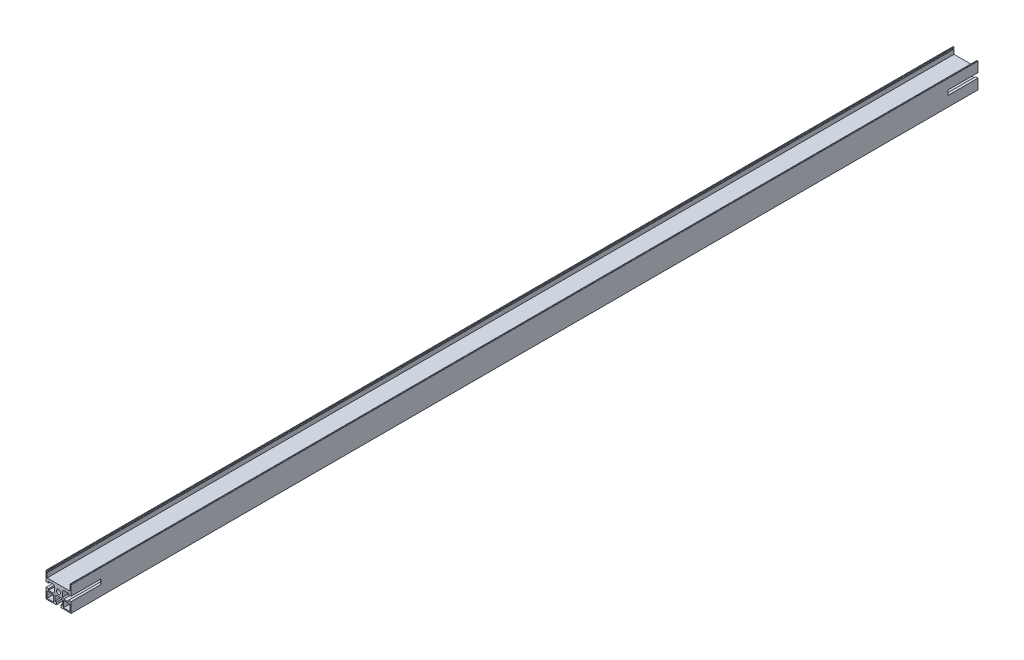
ISO-10303-21;
HEADER;
FILE_DESCRIPTION(('STEP AP214'),'2;1');
FILE_NAME('part.step','',(''),(''),'','','');
FILE_SCHEMA(('AUTOMOTIVE_DESIGN { 1 0 10303 214 1 1 1 1 }'));
ENDSEC;
DATA;
#1=APPLICATION_CONTEXT('core data for automotive mechanical design processes');
#2=APPLICATION_PROTOCOL_DEFINITION('international standard','automotive_design',2000,#1);
#3=PRODUCT_CONTEXT('',#1,'mechanical');
#4=PRODUCT('Part','Part','',(#3));
#5=PRODUCT_RELATED_PRODUCT_CATEGORY('part','',(#4));
#6=PRODUCT_DEFINITION_FORMATION('','',#4);
#7=PRODUCT_DEFINITION_CONTEXT('part definition',#1,'design');
#8=PRODUCT_DEFINITION('design','',#6,#7);
#9=PRODUCT_DEFINITION_SHAPE('','',#8);
#10=(LENGTH_UNIT() NAMED_UNIT(*) SI_UNIT(.MILLI.,.METRE.));
#11=(NAMED_UNIT(*) PLANE_ANGLE_UNIT() SI_UNIT($,.RADIAN.));
#12=(NAMED_UNIT(*) SI_UNIT($,.STERADIAN.) SOLID_ANGLE_UNIT());
#13=UNCERTAINTY_MEASURE_WITH_UNIT(LENGTH_MEASURE(1.E-05),#10,'distance_accuracy_value','');
#14=(GEOMETRIC_REPRESENTATION_CONTEXT(3) GLOBAL_UNCERTAINTY_ASSIGNED_CONTEXT((#13)) GLOBAL_UNIT_ASSIGNED_CONTEXT((#10,
#11,#12)) REPRESENTATION_CONTEXT('',''));
#15=CARTESIAN_POINT('',(0.,0.,0.));
#16=DIRECTION('',(0.,0.,1.));
#17=DIRECTION('',(1.,0.,0.));
#18=AXIS2_PLACEMENT_3D('',#15,#16,#17);
#19=CARTESIAN_POINT('',(22.,22.,812.9995));
#20=DIRECTION('',(0.,0.,1.));
#21=DIRECTION('',(1.,0.,0.));
#22=AXIS2_PLACEMENT_3D('',#19,#20,#21);
#23=PLANE('',#22);
#24=DIRECTION('',(1.,0.,0.));
#25=VECTOR('',#24,1.);
#26=CARTESIAN_POINT('',(-20.5,-20.5,812.9995));
#27=LINE('',#26,#25);
#28=CARTESIAN_POINT('',(-20.5,-20.5,812.9995));
#29=VERTEX_POINT('',#28);
#30=CARTESIAN_POINT('',(-8.80000000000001,-20.5,812.9995));
#31=VERTEX_POINT('',#30);
#32=EDGE_CURVE('E722',#29,#31,#27,.T.);
#33=ORIENTED_EDGE('',*,*,#32,.F.);
#34=DIRECTION('',(0.,-1.,0.));
#35=VECTOR('',#34,1.);
#36=CARTESIAN_POINT('',(-20.5,-8.8,812.9995));
#37=LINE('',#36,#35);
#38=CARTESIAN_POINT('',(-20.5,-8.8,812.9995));
#39=VERTEX_POINT('',#38);
#40=EDGE_CURVE('E719',#39,#29,#37,.T.);
#41=ORIENTED_EDGE('',*,*,#40,.F.);
#42=DIRECTION('',(-1.,0.,0.));
#43=VECTOR('',#42,1.);
#44=CARTESIAN_POINT('',(-20.5,-8.8,812.9995));
#45=LINE('',#44,#43);
#46=CARTESIAN_POINT('',(-8.80000000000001,-8.8,812.9995));
#47=VERTEX_POINT('',#46);
#48=EDGE_CURVE('E728',#47,#39,#45,.T.);
#49=ORIENTED_EDGE('',*,*,#48,.F.);
#50=DIRECTION('',(0.,1.,0.));
#51=VECTOR('',#50,1.);
#52=CARTESIAN_POINT('',(-8.80000000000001,-8.8,812.9995));
#53=LINE('',#52,#51);
#54=EDGE_CURVE('E725',#31,#47,#53,.T.);
#55=ORIENTED_EDGE('',*,*,#54,.F.);
#56=EDGE_LOOP('',(#33,#41,#49,#55));
#57=FACE_BOUND('',#56,.T.);
#58=CARTESIAN_POINT('',(0.,0.,812.9995));
#59=DIRECTION('',(0.,0.,1.));
#60=DIRECTION('',(1.,0.,0.));
#61=AXIS2_PLACEMENT_3D('',#58,#59,#60);
#62=CIRCLE('',#61,3.75);
#63=CARTESIAN_POINT('',(3.75,0.,812.9995));
#64=VERTEX_POINT('',#63);
#65=EDGE_CURVE('E731',#64,#64,#62,.T.);
#66=ORIENTED_EDGE('',*,*,#65,.F.);
#67=EDGE_LOOP('',(#66));
#68=FACE_BOUND('',#67,.T.);
#69=DIRECTION('',(0.,-1.,0.));
#70=VECTOR('',#69,1.);
#71=CARTESIAN_POINT('',(8.80000000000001,-8.8,812.9995));
#72=LINE('',#71,#70);
#73=CARTESIAN_POINT('',(8.80000000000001,-8.8,812.9995));
#74=VERTEX_POINT('',#73);
#75=CARTESIAN_POINT('',(8.80000000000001,-20.5,812.9995));
#76=VERTEX_POINT('',#75);
#77=EDGE_CURVE('E658',#74,#76,#72,.T.);
#78=ORIENTED_EDGE('',*,*,#77,.F.);
#79=DIRECTION('',(-1.,0.,0.));
#80=VECTOR('',#79,1.);
#81=CARTESIAN_POINT('',(20.5,-8.8,812.9995));
#82=LINE('',#81,#80);
#83=CARTESIAN_POINT('',(20.5,-8.8,812.9995));
#84=VERTEX_POINT('',#83);
#85=EDGE_CURVE('E655',#84,#74,#82,.T.);
#86=ORIENTED_EDGE('',*,*,#85,.F.);
#87=DIRECTION('',(0.,1.,0.));
#88=VECTOR('',#87,1.);
#89=CARTESIAN_POINT('',(20.5,-8.8,812.9995));
#90=LINE('',#89,#88);
#91=CARTESIAN_POINT('',(20.5,-20.5,812.9995));
#92=VERTEX_POINT('',#91);
#93=EDGE_CURVE('E664',#92,#84,#90,.T.);
#94=ORIENTED_EDGE('',*,*,#93,.F.);
#95=DIRECTION('',(1.,0.,0.));
#96=VECTOR('',#95,1.);
#97=CARTESIAN_POINT('',(20.5,-20.5,812.9995));
#98=LINE('',#97,#96);
#99=EDGE_CURVE('E661',#76,#92,#98,.T.);
#100=ORIENTED_EDGE('',*,*,#99,.F.);
#101=EDGE_LOOP('',(#78,#86,#94,#100));
#102=FACE_BOUND('',#101,.T.);
#103=DIRECTION('',(0.,-1.,0.));
#104=VECTOR('',#103,1.);
#105=CARTESIAN_POINT('',(-22.5,22.,812.9995));
#106=LINE('',#105,#104);
#107=CARTESIAN_POINT('',(-22.5,22.,812.9995));
#108=VERTEX_POINT('',#107);
#109=CARTESIAN_POINT('',(-22.5,4.25,812.9995));
#110=VERTEX_POINT('',#109);
#111=EDGE_CURVE('E823',#108,#110,#106,.T.);
#112=ORIENTED_EDGE('',*,*,#111,.T.);
#113=DIRECTION('',(-1.,0.,0.));
#114=VECTOR('',#113,1.);
#115=CARTESIAN_POINT('',(-18.,4.25,812.9995));
#116=LINE('',#115,#114);
#117=CARTESIAN_POINT('',(-18.,4.25,812.9995));
#118=VERTEX_POINT('',#117);
#119=EDGE_CURVE('E708',#118,#110,#116,.T.);
#120=ORIENTED_EDGE('',*,*,#119,.F.);
#121=DIRECTION('',(0.,-1.,0.));
#122=VECTOR('',#121,1.);
#123=CARTESIAN_POINT('',(-18.,6.79999999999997,812.9995));
#124=LINE('',#123,#122);
#125=CARTESIAN_POINT('',(-18.,6.79999999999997,812.9995));
#126=VERTEX_POINT('',#125);
#127=EDGE_CURVE('E705',#126,#118,#124,.T.);
#128=ORIENTED_EDGE('',*,*,#127,.F.);
#129=DIRECTION('',(-1.,0.,0.));
#130=VECTOR('',#129,1.);
#131=CARTESIAN_POINT('',(-9.2,6.79999999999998,812.9995));
#132=LINE('',#131,#130);
#133=CARTESIAN_POINT('',(-9.2,6.79999999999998,812.9995));
#134=VERTEX_POINT('',#133);
#135=EDGE_CURVE('E702',#134,#126,#132,.T.);
#136=ORIENTED_EDGE('',*,*,#135,.F.);
#137=DIRECTION('',(-0.707106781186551,0.707106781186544,0.));
#138=VECTOR('',#137,1.);
#139=CARTESIAN_POINT('',(-7.2,4.8,812.9995));
#140=LINE('',#139,#138);
#141=CARTESIAN_POINT('',(-7.2,4.8,812.9995));
#142=VERTEX_POINT('',#141);
#143=EDGE_CURVE('E699',#142,#134,#140,.T.);
#144=ORIENTED_EDGE('',*,*,#143,.F.);
#145=DIRECTION('',(0.,1.,0.));
#146=VECTOR('',#145,1.);
#147=CARTESIAN_POINT('',(-7.2,-4.8,812.9995));
#148=LINE('',#147,#146);
#149=CARTESIAN_POINT('',(-7.2,-4.8,812.9995));
#150=VERTEX_POINT('',#149);
#151=EDGE_CURVE('E696',#150,#142,#148,.T.);
#152=ORIENTED_EDGE('',*,*,#151,.F.);
#153=DIRECTION('',(0.707106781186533,0.707106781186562,0.));
#154=VECTOR('',#153,1.);
#155=CARTESIAN_POINT('',(-7.2,-4.8,812.9995));
#156=LINE('',#155,#154);
#157=CARTESIAN_POINT('',(-9.19999999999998,-6.80000000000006,812.9995));
#158=VERTEX_POINT('',#157);
#159=EDGE_CURVE('E693',#158,#150,#156,.T.);
#160=ORIENTED_EDGE('',*,*,#159,.F.);
#161=DIRECTION('',(1.,0.,0.));
#162=VECTOR('',#161,1.);
#163=CARTESIAN_POINT('',(-9.19999999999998,-6.80000000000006,812.9995));
#164=LINE('',#163,#162);
#165=CARTESIAN_POINT('',(-18.,-6.80000000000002,812.9995));
#166=VERTEX_POINT('',#165);
#167=EDGE_CURVE('E716',#166,#158,#164,.T.);
#168=ORIENTED_EDGE('',*,*,#167,.F.);
#169=DIRECTION('',(0.,-1.,0.));
#170=VECTOR('',#169,1.);
#171=CARTESIAN_POINT('',(-18.,-6.80000000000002,812.9995));
#172=LINE('',#171,#170);
#173=CARTESIAN_POINT('',(-18.,-4.25,812.9995));
#174=VERTEX_POINT('',#173);
#175=EDGE_CURVE('E713',#174,#166,#172,.T.);
#176=ORIENTED_EDGE('',*,*,#175,.F.);
#177=DIRECTION('',(1.,0.,0.));
#178=VECTOR('',#177,1.);
#179=CARTESIAN_POINT('',(-18.,-4.25,812.9995));
#180=LINE('',#179,#178);
#181=CARTESIAN_POINT('',(-22.5,-4.25,812.9995));
#182=VERTEX_POINT('',#181);
#183=EDGE_CURVE('E710',#182,#174,#180,.T.);
#184=ORIENTED_EDGE('',*,*,#183,.F.);
#185=CARTESIAN_POINT('',(-22.5,-22.5,812.9995));
#186=VERTEX_POINT('',#185);
#187=EDGE_CURVE('E822',#182,#186,#106,.T.);
#188=ORIENTED_EDGE('',*,*,#187,.T.);
#189=DIRECTION('',(1.,0.,0.));
#190=VECTOR('',#189,1.);
#191=CARTESIAN_POINT('',(-22.5,-22.5,812.9995));
#192=LINE('',#191,#190);
#193=CARTESIAN_POINT('',(-4.1,-22.5,812.9995));
#194=VERTEX_POINT('',#193);
#195=EDGE_CURVE('E734',#186,#194,#192,.T.);
#196=ORIENTED_EDGE('',*,*,#195,.T.);
#197=DIRECTION('',(0.,1.,0.));
#198=VECTOR('',#197,1.);
#199=CARTESIAN_POINT('',(-4.1,-22.5,812.9995));
#200=LINE('',#199,#198);
#201=CARTESIAN_POINT('',(-4.1,-18.,812.9995));
#202=VERTEX_POINT('',#201);
#203=EDGE_CURVE('E737',#194,#202,#200,.T.);
#204=ORIENTED_EDGE('',*,*,#203,.T.);
#205=DIRECTION('',(-1.,0.,0.));
#206=VECTOR('',#205,1.);
#207=CARTESIAN_POINT('',(-4.1,-18.,812.9995));
#208=LINE('',#207,#206);
#209=CARTESIAN_POINT('',(-6.8,-18.,812.9995));
#210=VERTEX_POINT('',#209);
#211=EDGE_CURVE('E740',#202,#210,#208,.T.);
#212=ORIENTED_EDGE('',*,*,#211,.T.);
#213=DIRECTION('',(0.,1.,0.));
#214=VECTOR('',#213,1.);
#215=CARTESIAN_POINT('',(-6.8,-18.,812.9995));
#216=LINE('',#215,#214);
#217=CARTESIAN_POINT('',(-6.8,-9.5,812.9995));
#218=VERTEX_POINT('',#217);
#219=EDGE_CURVE('E743',#210,#218,#216,.T.);
#220=ORIENTED_EDGE('',*,*,#219,.T.);
#221=DIRECTION('',(0.707106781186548,0.707106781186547,0.));
#222=VECTOR('',#221,1.);
#223=CARTESIAN_POINT('',(-6.8,-9.5,812.9995));
#224=LINE('',#223,#222);
#225=CARTESIAN_POINT('',(-4.5,-7.2,812.9995));
#226=VERTEX_POINT('',#225);
#227=EDGE_CURVE('E746',#218,#226,#224,.T.);
#228=ORIENTED_EDGE('',*,*,#227,.T.);
#229=DIRECTION('',(1.,0.,0.));
#230=VECTOR('',#229,1.);
#231=CARTESIAN_POINT('',(-4.5,-7.2,812.9995));
#232=LINE('',#231,#230);
#233=CARTESIAN_POINT('',(4.5,-7.2,812.9995));
#234=VERTEX_POINT('',#233);
#235=EDGE_CURVE('E749',#226,#234,#232,.T.);
#236=ORIENTED_EDGE('',*,*,#235,.T.);
#237=DIRECTION('',(0.707106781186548,-0.707106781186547,0.));
#238=VECTOR('',#237,1.);
#239=CARTESIAN_POINT('',(6.8,-9.5,812.9995));
#240=LINE('',#239,#238);
#241=CARTESIAN_POINT('',(6.8,-9.5,812.9995));
#242=VERTEX_POINT('',#241);
#243=EDGE_CURVE('E752',#234,#242,#240,.T.);
#244=ORIENTED_EDGE('',*,*,#243,.T.);
#245=DIRECTION('',(0.,-1.,0.));
#246=VECTOR('',#245,1.);
#247=CARTESIAN_POINT('',(6.8,-18.,812.9995));
#248=LINE('',#247,#246);
#249=CARTESIAN_POINT('',(6.8,-18.,812.9995));
#250=VERTEX_POINT('',#249);
#251=EDGE_CURVE('E755',#242,#250,#248,.T.);
#252=ORIENTED_EDGE('',*,*,#251,.T.);
#253=DIRECTION('',(-1.,0.,0.));
#254=VECTOR('',#253,1.);
#255=CARTESIAN_POINT('',(4.1,-18.,812.9995));
#256=LINE('',#255,#254);
#257=CARTESIAN_POINT('',(4.1,-18.,812.9995));
#258=VERTEX_POINT('',#257);
#259=EDGE_CURVE('E758',#250,#258,#256,.T.);
#260=ORIENTED_EDGE('',*,*,#259,.T.);
#261=DIRECTION('',(0.,-1.,0.));
#262=VECTOR('',#261,1.);
#263=CARTESIAN_POINT('',(4.1,-22.5,812.9995));
#264=LINE('',#263,#262);
#265=CARTESIAN_POINT('',(4.1,-22.5,812.9995));
#266=VERTEX_POINT('',#265);
#267=EDGE_CURVE('E761',#258,#266,#264,.T.);
#268=ORIENTED_EDGE('',*,*,#267,.T.);
#269=DIRECTION('',(1.,0.,0.));
#270=VECTOR('',#269,1.);
#271=CARTESIAN_POINT('',(22.5,-22.5,812.9995));
#272=LINE('',#271,#270);
#273=CARTESIAN_POINT('',(22.5,-22.5,812.9995));
#274=VERTEX_POINT('',#273);
#275=EDGE_CURVE('E764',#266,#274,#272,.T.);
#276=ORIENTED_EDGE('',*,*,#275,.T.);
#277=DIRECTION('',(0.,1.,0.));
#278=VECTOR('',#277,1.);
#279=CARTESIAN_POINT('',(22.5,22.,812.9995));
#280=LINE('',#279,#278);
#281=CARTESIAN_POINT('',(22.5,-4.25,812.9995));
#282=VERTEX_POINT('',#281);
#283=EDGE_CURVE('E768',#274,#282,#280,.T.);
#284=ORIENTED_EDGE('',*,*,#283,.T.);
#285=DIRECTION('',(1.,0.,0.));
#286=VECTOR('',#285,1.);
#287=CARTESIAN_POINT('',(18.,-4.25,812.9995));
#288=LINE('',#287,#286);
#289=CARTESIAN_POINT('',(18.,-4.25,812.9995));
#290=VERTEX_POINT('',#289);
#291=EDGE_CURVE('E691',#290,#282,#288,.T.);
#292=ORIENTED_EDGE('',*,*,#291,.F.);
#293=DIRECTION('',(0.,1.,0.));
#294=VECTOR('',#293,1.);
#295=CARTESIAN_POINT('',(18.,-6.80000000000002,812.9995));
#296=LINE('',#295,#294);
#297=CARTESIAN_POINT('',(18.,-6.80000000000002,812.9995));
#298=VERTEX_POINT('',#297);
#299=EDGE_CURVE('E688',#298,#290,#296,.T.);
#300=ORIENTED_EDGE('',*,*,#299,.F.);
#301=DIRECTION('',(1.,0.,0.));
#302=VECTOR('',#301,1.);
#303=CARTESIAN_POINT('',(9.19999999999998,-6.80000000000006,812.9995));
#304=LINE('',#303,#302);
#305=CARTESIAN_POINT('',(9.19999999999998,-6.80000000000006,812.9995));
#306=VERTEX_POINT('',#305);
#307=EDGE_CURVE('E685',#306,#298,#304,.T.);
#308=ORIENTED_EDGE('',*,*,#307,.F.);
#309=DIRECTION('',(0.707106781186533,-0.707106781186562,0.));
#310=VECTOR('',#309,1.);
#311=CARTESIAN_POINT('',(7.2,-4.8,812.9995));
#312=LINE('',#311,#310);
#313=CARTESIAN_POINT('',(7.2,-4.8,812.9995));
#314=VERTEX_POINT('',#313);
#315=EDGE_CURVE('E682',#314,#306,#312,.T.);
#316=ORIENTED_EDGE('',*,*,#315,.F.);
#317=DIRECTION('',(0.,-1.,0.));
#318=VECTOR('',#317,1.);
#319=CARTESIAN_POINT('',(7.2,-4.8,812.9995));
#320=LINE('',#319,#318);
#321=CARTESIAN_POINT('',(7.2,4.8,812.9995));
#322=VERTEX_POINT('',#321);
#323=EDGE_CURVE('E679',#322,#314,#320,.T.);
#324=ORIENTED_EDGE('',*,*,#323,.F.);
#325=DIRECTION('',(-0.707106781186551,-0.707106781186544,0.));
#326=VECTOR('',#325,1.);
#327=CARTESIAN_POINT('',(7.2,4.8,812.9995));
#328=LINE('',#327,#326);
#329=CARTESIAN_POINT('',(9.2,6.79999999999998,812.9995));
#330=VERTEX_POINT('',#329);
#331=EDGE_CURVE('E676',#330,#322,#328,.T.);
#332=ORIENTED_EDGE('',*,*,#331,.F.);
#333=DIRECTION('',(-1.,0.,0.));
#334=VECTOR('',#333,1.);
#335=CARTESIAN_POINT('',(9.2,6.79999999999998,812.9995));
#336=LINE('',#335,#334);
#337=CARTESIAN_POINT('',(18.,6.79999999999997,812.9995));
#338=VERTEX_POINT('',#337);
#339=EDGE_CURVE('E673',#338,#330,#336,.T.);
#340=ORIENTED_EDGE('',*,*,#339,.F.);
#341=DIRECTION('',(0.,1.,0.));
#342=VECTOR('',#341,1.);
#343=CARTESIAN_POINT('',(18.,6.79999999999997,812.9995));
#344=LINE('',#343,#342);
#345=CARTESIAN_POINT('',(18.,4.25,812.9995));
#346=VERTEX_POINT('',#345);
#347=EDGE_CURVE('E670',#346,#338,#344,.T.);
#348=ORIENTED_EDGE('',*,*,#347,.F.);
#349=DIRECTION('',(-1.,0.,0.));
#350=VECTOR('',#349,1.);
#351=CARTESIAN_POINT('',(18.,4.25,812.9995));
#352=LINE('',#351,#350);
#353=CARTESIAN_POINT('',(22.5,4.25,812.9995));
#354=VERTEX_POINT('',#353);
#355=EDGE_CURVE('E667',#354,#346,#352,.T.);
#356=ORIENTED_EDGE('',*,*,#355,.F.);
#357=CARTESIAN_POINT('',(22.5,22.,812.9995));
#358=VERTEX_POINT('',#357);
#359=EDGE_CURVE('E767',#354,#358,#280,.T.);
#360=ORIENTED_EDGE('',*,*,#359,.T.);
#361=CARTESIAN_POINT('',(22.,22.,812.9995));
#362=DIRECTION('',(0.,0.,1.));
#363=DIRECTION('',(1.,0.,0.));
#364=AXIS2_PLACEMENT_3D('',#361,#362,#363);
#365=CIRCLE('',#364,0.499999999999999);
#366=CARTESIAN_POINT('',(22.,22.5,812.9995));
#367=VERTEX_POINT('',#366);
#368=EDGE_CURVE('E771',#358,#367,#365,.T.);
#369=ORIENTED_EDGE('',*,*,#368,.T.);
#370=DIRECTION('',(-1.,0.,0.));
#371=VECTOR('',#370,1.);
#372=CARTESIAN_POINT('',(22.,22.5,812.9995));
#373=LINE('',#372,#371);
#374=CARTESIAN_POINT('',(21.,22.5,812.9995));
#375=VERTEX_POINT('',#374);
#376=EDGE_CURVE('E774',#367,#375,#373,.T.);
#377=ORIENTED_EDGE('',*,*,#376,.T.);
#378=CARTESIAN_POINT('',(21.,22.,812.9995));
#379=DIRECTION('',(0.,0.,1.));
#380=DIRECTION('',(1.,0.,0.));
#381=AXIS2_PLACEMENT_3D('',#378,#379,#380);
#382=CIRCLE('',#381,0.5);
#383=CARTESIAN_POINT('',(20.5,22.,812.9995));
#384=VERTEX_POINT('',#383);
#385=EDGE_CURVE('E777',#375,#384,#382,.T.);
#386=ORIENTED_EDGE('',*,*,#385,.T.);
#387=DIRECTION('',(0.,-1.,0.));
#388=VECTOR('',#387,1.);
#389=CARTESIAN_POINT('',(20.5,22.,812.9995));
#390=LINE('',#389,#388);
#391=CARTESIAN_POINT('',(20.5,21.7688577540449,812.9995));
#392=VERTEX_POINT('',#391);
#393=EDGE_CURVE('E780',#384,#392,#390,.T.);
#394=ORIENTED_EDGE('',*,*,#393,.T.);
#395=CARTESIAN_POINT('',(21.,21.7688577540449,812.9995));
#396=DIRECTION('',(0.,0.,1.));
#397=DIRECTION('',(1.,0.,0.));
#398=AXIS2_PLACEMENT_3D('',#395,#396,#397);
#399=CIRCLE('',#398,0.500000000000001);
#400=CARTESIAN_POINT('',(20.7333333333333,21.3459051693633,812.9995));
#401=VERTEX_POINT('',#400);
#402=EDGE_CURVE('E783',#392,#401,#399,.T.);
#403=ORIENTED_EDGE('',*,*,#402,.T.);
#404=CARTESIAN_POINT('',(20.2,20.5,812.9995));
#405=DIRECTION('',(0.,0.,-1.));
#406=DIRECTION('',(-1.,0.,0.));
#407=AXIS2_PLACEMENT_3D('',#404,#405,#406);
#408=CIRCLE('',#407,0.999999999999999);
#409=CARTESIAN_POINT('',(20.7333333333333,19.6540948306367,812.9995));
#410=VERTEX_POINT('',#409);
#411=EDGE_CURVE('E786',#401,#410,#408,.T.);
#412=ORIENTED_EDGE('',*,*,#411,.T.);
#413=CARTESIAN_POINT('',(21.,19.231142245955,812.9995));
#414=DIRECTION('',(0.,0.,1.));
#415=DIRECTION('',(-1.,0.,0.));
#416=AXIS2_PLACEMENT_3D('',#413,#414,#415);
#417=CIRCLE('',#416,0.5);
#418=CARTESIAN_POINT('',(20.5,19.231142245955,812.9995));
#419=VERTEX_POINT('',#418);
#420=EDGE_CURVE('E789',#410,#419,#417,.T.);
#421=ORIENTED_EDGE('',*,*,#420,.T.);
#422=DIRECTION('',(0.,-1.,0.));
#423=VECTOR('',#422,1.);
#424=CARTESIAN_POINT('',(20.5,19.231142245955,812.9995));
#425=LINE('',#424,#423);
#426=CARTESIAN_POINT('',(20.5,11.2213938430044,812.9995));
#427=VERTEX_POINT('',#426);
#428=EDGE_CURVE('E792',#419,#427,#425,.T.);
#429=ORIENTED_EDGE('',*,*,#428,.T.);
#430=DIRECTION('',(-1.,0.,0.));
#431=VECTOR('',#430,1.);
#432=CARTESIAN_POINT('',(-20.5,11.2213938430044,812.9995));
#433=LINE('',#432,#431);
#434=CARTESIAN_POINT('',(-20.5,11.2213938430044,812.9995));
#435=VERTEX_POINT('',#434);
#436=EDGE_CURVE('E795',#427,#435,#433,.T.);
#437=ORIENTED_EDGE('',*,*,#436,.T.);
#438=DIRECTION('',(0.,1.,0.));
#439=VECTOR('',#438,1.);
#440=CARTESIAN_POINT('',(-20.5,19.231142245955,812.9995));
#441=LINE('',#440,#439);
#442=CARTESIAN_POINT('',(-20.5,19.231142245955,812.9995));
#443=VERTEX_POINT('',#442);
#444=EDGE_CURVE('E798',#435,#443,#441,.T.);
#445=ORIENTED_EDGE('',*,*,#444,.T.);
#446=CARTESIAN_POINT('',(-21.,19.231142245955,812.9995));
#447=DIRECTION('',(0.,0.,1.));
#448=DIRECTION('',(1.,0.,0.));
#449=AXIS2_PLACEMENT_3D('',#446,#447,#448);
#450=CIRCLE('',#449,0.5);
#451=CARTESIAN_POINT('',(-20.7333333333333,19.6540948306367,812.9995));
#452=VERTEX_POINT('',#451);
#453=EDGE_CURVE('E801',#443,#452,#450,.T.);
#454=ORIENTED_EDGE('',*,*,#453,.T.);
#455=CARTESIAN_POINT('',(-20.2,20.5,812.9995));
#456=DIRECTION('',(0.,0.,-1.));
#457=DIRECTION('',(1.,0.,0.));
#458=AXIS2_PLACEMENT_3D('',#455,#456,#457);
#459=CIRCLE('',#458,0.999999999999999);
#460=CARTESIAN_POINT('',(-20.7333333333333,21.3459051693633,812.9995));
#461=VERTEX_POINT('',#460);
#462=EDGE_CURVE('E804',#452,#461,#459,.T.);
#463=ORIENTED_EDGE('',*,*,#462,.T.);
#464=CARTESIAN_POINT('',(-21.,21.7688577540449,812.9995));
#465=DIRECTION('',(0.,0.,1.));
#466=DIRECTION('',(-1.,0.,0.));
#467=AXIS2_PLACEMENT_3D('',#464,#465,#466);
#468=CIRCLE('',#467,0.500000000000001);
#469=CARTESIAN_POINT('',(-20.5,21.7688577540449,812.9995));
#470=VERTEX_POINT('',#469);
#471=EDGE_CURVE('E807',#461,#470,#468,.T.);
#472=ORIENTED_EDGE('',*,*,#471,.T.);
#473=DIRECTION('',(0.,1.,0.));
#474=VECTOR('',#473,1.);
#475=CARTESIAN_POINT('',(-20.5,22.,812.9995));
#476=LINE('',#475,#474);
#477=CARTESIAN_POINT('',(-20.5,22.,812.9995));
#478=VERTEX_POINT('',#477);
#479=EDGE_CURVE('E810',#470,#478,#476,.T.);
#480=ORIENTED_EDGE('',*,*,#479,.T.);
#481=CARTESIAN_POINT('',(-21.,22.,812.9995));
#482=DIRECTION('',(0.,0.,1.));
#483=DIRECTION('',(-1.,0.,0.));
#484=AXIS2_PLACEMENT_3D('',#481,#482,#483);
#485=CIRCLE('',#484,0.5);
#486=CARTESIAN_POINT('',(-21.,22.5,812.9995));
#487=VERTEX_POINT('',#486);
#488=EDGE_CURVE('E813',#478,#487,#485,.T.);
#489=ORIENTED_EDGE('',*,*,#488,.T.);
#490=DIRECTION('',(-1.,0.,0.));
#491=VECTOR('',#490,1.);
#492=CARTESIAN_POINT('',(-22.,22.5,812.9995));
#493=LINE('',#492,#491);
#494=CARTESIAN_POINT('',(-22.,22.5,812.9995));
#495=VERTEX_POINT('',#494);
#496=EDGE_CURVE('E816',#487,#495,#493,.T.);
#497=ORIENTED_EDGE('',*,*,#496,.T.);
#498=CARTESIAN_POINT('',(-22.,22.,812.9995));
#499=DIRECTION('',(0.,0.,1.));
#500=DIRECTION('',(-1.,0.,0.));
#501=AXIS2_PLACEMENT_3D('',#498,#499,#500);
#502=CIRCLE('',#501,0.499999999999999);
#503=EDGE_CURVE('E819',#495,#108,#502,.T.);
#504=ORIENTED_EDGE('',*,*,#503,.T.);
#505=EDGE_LOOP('',(#112,#120,#128,#136,#144,#152,#160,#168,#176,#184,#188,#196,#204,#212,#220,
#228,#236,#244,#252,#260,#268,#276,#284,#292,#300,#308,#316,#324,#332,#340,#348,#356,#360,#369,
#377,#386,#394,#403,#412,#421,#429,#437,#445,#454,#463,#472,#480,#489,#497,#504));
#506=FACE_BOUND('',#505,.T.);
#507=ADVANCED_FACE('F30',(#57,#68,#102,#506),#23,.T.);
#508=CARTESIAN_POINT('',(-22.5,22.,-812.9995));
#509=DIRECTION('',(-1.,0.,0.));
#510=DIRECTION('',(0.,-1.,0.));
#511=AXIS2_PLACEMENT_3D('',#508,#509,#510);
#512=PLANE('',#511);
#513=DIRECTION('',(0.,0.,1.));
#514=VECTOR('',#513,1.);
#515=CARTESIAN_POINT('',(-22.5,-4.25,-1265.34538269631));
#516=LINE('',#515,#514);
#517=CARTESIAN_POINT('',(-22.5,-4.25,-812.9995));
#518=VERTEX_POINT('',#517);
#519=CARTESIAN_POINT('',(-22.5,-4.25,-759.0245));
#520=VERTEX_POINT('',#519);
#521=EDGE_CURVE('E527',#518,#520,#516,.T.);
#522=ORIENTED_EDGE('',*,*,#521,.F.);
#523=DIRECTION('',(0.,-1.,0.));
#524=VECTOR('',#523,1.);
#525=CARTESIAN_POINT('',(-22.5,22.,-812.9995));
#526=LINE('',#525,#524);
#527=CARTESIAN_POINT('',(-22.5,-22.5,-812.9995));
#528=VERTEX_POINT('',#527);
#529=EDGE_CURVE('E1070',#518,#528,#526,.T.);
#530=ORIENTED_EDGE('',*,*,#529,.T.);
#531=DIRECTION('',(0.,0.,1.));
#532=VECTOR('',#531,1.);
#533=CARTESIAN_POINT('',(-22.5,-22.5,-812.9995));
#534=LINE('',#533,#532);
#535=EDGE_CURVE('E38',#528,#186,#534,.T.);
#536=ORIENTED_EDGE('',*,*,#535,.T.);
#537=ORIENTED_EDGE('',*,*,#187,.F.);
#538=DIRECTION('',(0.,0.,1.));
#539=VECTOR('',#538,1.);
#540=CARTESIAN_POINT('',(-22.5,-4.25,-1265.34538269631));
#541=LINE('',#540,#539);
#542=CARTESIAN_POINT('',(-22.5,-4.25,759.0245));
#543=VERTEX_POINT('',#542);
#544=EDGE_CURVE('E567',#543,#182,#541,.T.);
#545=ORIENTED_EDGE('',*,*,#544,.F.);
#546=DIRECTION('',(0.,-1.,0.));
#547=VECTOR('',#546,1.);
#548=CARTESIAN_POINT('',(-22.5,-0.250000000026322,759.0245));
#549=LINE('',#548,#547);
#550=CARTESIAN_POINT('',(-22.5,4.25,759.0245));
#551=VERTEX_POINT('',#550);
#552=EDGE_CURVE('E564',#551,#543,#549,.T.);
#553=ORIENTED_EDGE('',*,*,#552,.F.);
#554=DIRECTION('',(0.,0.,1.));
#555=VECTOR('',#554,1.);
#556=CARTESIAN_POINT('',(-22.5,4.25,-1265.34538269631));
#557=LINE('',#556,#555);
#558=EDGE_CURVE('E570',#551,#110,#557,.T.);
#559=ORIENTED_EDGE('',*,*,#558,.T.);
#560=ORIENTED_EDGE('',*,*,#111,.F.);
#561=DIRECTION('',(0.,0.,1.));
#562=VECTOR('',#561,1.);
#563=CARTESIAN_POINT('',(-22.5,22.,-812.9995));
#564=LINE('',#563,#562);
#565=CARTESIAN_POINT('',(-22.5,22.,-812.9995));
#566=VERTEX_POINT('',#565);
#567=EDGE_CURVE('E1075',#566,#108,#564,.T.);
#568=ORIENTED_EDGE('',*,*,#567,.F.);
#569=CARTESIAN_POINT('',(-22.5,4.25,-812.9995));
#570=VERTEX_POINT('',#569);
#571=EDGE_CURVE('E539',#566,#570,#526,.T.);
#572=ORIENTED_EDGE('',*,*,#571,.T.);
#573=DIRECTION('',(0.,0.,1.));
#574=VECTOR('',#573,1.);
#575=CARTESIAN_POINT('',(-22.5,4.25,-1265.34538269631));
#576=LINE('',#575,#574);
#577=CARTESIAN_POINT('',(-22.5,4.25,-759.0245));
#578=VERTEX_POINT('',#577);
#579=EDGE_CURVE('E523',#570,#578,#576,.T.);
#580=ORIENTED_EDGE('',*,*,#579,.T.);
#581=DIRECTION('',(0.,1.,0.));
#582=VECTOR('',#581,1.);
#583=CARTESIAN_POINT('',(-22.5,-0.249999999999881,-759.0245));
#584=LINE('',#583,#582);
#585=EDGE_CURVE('E530',#520,#578,#584,.T.);
#586=ORIENTED_EDGE('',*,*,#585,.F.);
#587=EDGE_LOOP('',(#522,#530,#536,#537,#545,#553,#559,#560,#568,#572,#580,#586));
#588=FACE_BOUND('',#587,.T.);
#589=ADVANCED_FACE('F537',(#588),#512,.T.);
#590=CARTESIAN_POINT('',(23.5,1.71446609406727,-812.9995));
#591=DIRECTION('',(0.,0.,1.));
#592=DIRECTION('',(1.,0.,0.));
#593=AXIS2_PLACEMENT_3D('',#590,#591,#592);
#594=CYLINDRICAL_SURFACE('',#593,2.5);
#595=CARTESIAN_POINT('',(23.5,1.71446609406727,-759.0245));
#596=DIRECTION('',(0.,0.,-1.));
#597=DIRECTION('',(-1.,0.,0.));
#598=AXIS2_PLACEMENT_3D('',#595,#596,#597);
#599=CIRCLE('',#598,2.5);
#600=CARTESIAN_POINT('',(21.,1.71446609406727,-759.0245));
#601=VERTEX_POINT('',#600);
#602=CARTESIAN_POINT('',(21.7322330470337,3.48223304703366,-759.0245));
#603=VERTEX_POINT('',#602);
#604=EDGE_CURVE('E614',#601,#603,#599,.T.);
#605=ORIENTED_EDGE('',*,*,#604,.F.);
#606=DIRECTION('',(0.,0.,1.));
#607=VECTOR('',#606,1.);
#608=CARTESIAN_POINT('',(21.,1.71446609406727,-812.9995));
#609=LINE('',#608,#607);
#610=CARTESIAN_POINT('',(21.,1.71446609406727,759.0245));
#611=VERTEX_POINT('',#610);
#612=EDGE_CURVE('E871',#601,#611,#609,.T.);
#613=ORIENTED_EDGE('',*,*,#612,.T.);
#614=CARTESIAN_POINT('',(23.5,1.71446609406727,759.0245));
#615=DIRECTION('',(0.,0.,1.));
#616=DIRECTION('',(0.,-1.,0.));
#617=AXIS2_PLACEMENT_3D('',#614,#615,#616);
#618=CIRCLE('',#617,2.5);
#619=CARTESIAN_POINT('',(21.7322330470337,3.48223304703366,759.0245));
#620=VERTEX_POINT('',#619);
#621=EDGE_CURVE('E640',#620,#611,#618,.T.);
#622=ORIENTED_EDGE('',*,*,#621,.F.);
#623=DIRECTION('',(0.,0.,1.));
#624=VECTOR('',#623,1.);
#625=CARTESIAN_POINT('',(21.7322330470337,3.48223304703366,-812.9995));
#626=LINE('',#625,#624);
#627=EDGE_CURVE('E870',#603,#620,#626,.T.);
#628=ORIENTED_EDGE('',*,*,#627,.F.);
#629=EDGE_LOOP('',(#605,#613,#622,#628));
#630=FACE_BOUND('',#629,.T.);
#631=ADVANCED_FACE('F1228',(#630),#594,.T.);
#632=CARTESIAN_POINT('',(21.,1.71446609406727,-812.9995));
#633=DIRECTION('',(1.,0.,0.));
#634=DIRECTION('',(0.,1.,0.));
#635=AXIS2_PLACEMENT_3D('',#632,#633,#634);
#636=PLANE('',#635);
#637=DIRECTION('',(0.,1.,0.));
#638=VECTOR('',#637,1.);
#639=CARTESIAN_POINT('',(21.,1.71446609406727,-759.0245));
#640=LINE('',#639,#638);
#641=CARTESIAN_POINT('',(21.,-1.71446609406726,-759.0245));
#642=VERTEX_POINT('',#641);
#643=EDGE_CURVE('E616',#642,#601,#640,.T.);
#644=ORIENTED_EDGE('',*,*,#643,.F.);
#645=DIRECTION('',(0.,0.,1.));
#646=VECTOR('',#645,1.);
#647=CARTESIAN_POINT('',(21.,-1.71446609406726,-812.9995));
#648=LINE('',#647,#646);
#649=CARTESIAN_POINT('',(21.,-1.71446609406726,759.0245));
#650=VERTEX_POINT('',#649);
#651=EDGE_CURVE('E874',#642,#650,#648,.T.);
#652=ORIENTED_EDGE('',*,*,#651,.T.);
#653=DIRECTION('',(0.,-1.,0.));
#654=VECTOR('',#653,1.);
#655=CARTESIAN_POINT('',(21.,1.71446609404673,759.0245));
#656=LINE('',#655,#654);
#657=EDGE_CURVE('E643',#611,#650,#656,.T.);
#658=ORIENTED_EDGE('',*,*,#657,.F.);
#659=ORIENTED_EDGE('',*,*,#612,.F.);
#660=EDGE_LOOP('',(#644,#652,#658,#659));
#661=FACE_BOUND('',#660,.T.);
#662=ADVANCED_FACE('F1223',(#661),#636,.F.);
#663=CARTESIAN_POINT('',(23.5,-1.71446609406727,-812.9995));
#664=DIRECTION('',(0.,0.,1.));
#665=DIRECTION('',(1.,0.,0.));
#666=AXIS2_PLACEMENT_3D('',#663,#664,#665);
#667=CYLINDRICAL_SURFACE('',#666,2.5);
#668=CARTESIAN_POINT('',(23.5,-1.71446609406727,-759.0245));
#669=DIRECTION('',(0.,0.,-1.));
#670=DIRECTION('',(-1.,0.,0.));
#671=AXIS2_PLACEMENT_3D('',#668,#669,#670);
#672=CIRCLE('',#671,2.5);
#673=CARTESIAN_POINT('',(21.7322330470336,-3.48223304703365,-759.0245));
#674=VERTEX_POINT('',#673);
#675=EDGE_CURVE('E618',#674,#642,#672,.T.);
#676=ORIENTED_EDGE('',*,*,#675,.F.);
#677=DIRECTION('',(0.,0.,1.));
#678=VECTOR('',#677,1.);
#679=CARTESIAN_POINT('',(21.7322330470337,-3.48223304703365,-812.9995));
#680=LINE('',#679,#678);
#681=CARTESIAN_POINT('',(21.7322330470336,-3.48223304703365,759.0245));
#682=VERTEX_POINT('',#681);
#683=EDGE_CURVE('E876',#674,#682,#680,.T.);
#684=ORIENTED_EDGE('',*,*,#683,.T.);
#685=CARTESIAN_POINT('',(23.5,-1.71446609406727,759.0245));
#686=DIRECTION('',(0.,0.,1.));
#687=DIRECTION('',(0.,-1.,0.));
#688=AXIS2_PLACEMENT_3D('',#685,#686,#687);
#689=CIRCLE('',#688,2.5);
#690=EDGE_CURVE('E646',#650,#682,#689,.T.);
#691=ORIENTED_EDGE('',*,*,#690,.F.);
#692=ORIENTED_EDGE('',*,*,#651,.F.);
#693=EDGE_LOOP('',(#676,#684,#691,#692));
#694=FACE_BOUND('',#693,.T.);
#695=ADVANCED_FACE('F1216',(#694),#667,.T.);
#696=CARTESIAN_POINT('',(22.2,-3.95,-812.9995));
#697=DIRECTION('',(0.707106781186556,0.707106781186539,0.));
#698=DIRECTION('',(-0.707106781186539,0.707106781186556,0.));
#699=AXIS2_PLACEMENT_3D('',#696,#697,#698);
#700=PLANE('',#699);
#701=DIRECTION('',(-0.707106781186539,0.707106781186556,0.));
#702=VECTOR('',#701,1.);
#703=CARTESIAN_POINT('',(22.2,-3.95,-759.0245));
#704=LINE('',#703,#702);
#705=CARTESIAN_POINT('',(22.2,-3.95,-759.0245));
#706=VERTEX_POINT('',#705);
#707=EDGE_CURVE('E620',#706,#674,#704,.T.);
#708=ORIENTED_EDGE('',*,*,#707,.F.);
#709=DIRECTION('',(0.,0.,1.));
#710=VECTOR('',#709,1.);
#711=CARTESIAN_POINT('',(22.2,-3.95,-812.9995));
#712=LINE('',#711,#710);
#713=CARTESIAN_POINT('',(22.2,-3.95,759.0245));
#714=VERTEX_POINT('',#713);
#715=EDGE_CURVE('E878',#706,#714,#712,.T.);
#716=ORIENTED_EDGE('',*,*,#715,.T.);
#717=DIRECTION('',(0.707106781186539,-0.707106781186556,0.));
#718=VECTOR('',#717,1.);
#719=CARTESIAN_POINT('',(22.2000000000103,-3.95000000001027,759.0245));
#720=LINE('',#719,#718);
#721=EDGE_CURVE('E649',#682,#714,#720,.T.);
#722=ORIENTED_EDGE('',*,*,#721,.F.);
#723=ORIENTED_EDGE('',*,*,#683,.F.);
#724=EDGE_LOOP('',(#708,#716,#722,#723));
#725=FACE_BOUND('',#724,.T.);
#726=ADVANCED_FACE('F1212',(#725),#700,.F.);
#727=CARTESIAN_POINT('',(22.2,-4.25,-812.9995));
#728=DIRECTION('',(1.,0.,0.));
#729=DIRECTION('',(0.,0.,-1.));
#730=AXIS2_PLACEMENT_3D('',#727,#728,#729);
#731=PLANE('',#730);
#732=DIRECTION('',(0.,1.,0.));
#733=VECTOR('',#732,1.);
#734=CARTESIAN_POINT('',(22.2,-4.25,-759.0245));
#735=LINE('',#734,#733);
#736=CARTESIAN_POINT('',(22.2,-4.25,-759.0245));
#737=VERTEX_POINT('',#736);
#738=EDGE_CURVE('E622',#737,#706,#735,.T.);
#739=ORIENTED_EDGE('',*,*,#738,.F.);
#740=DIRECTION('',(0.,0.,1.));
#741=VECTOR('',#740,1.);
#742=CARTESIAN_POINT('',(22.2,-4.25,-812.9995));
#743=LINE('',#742,#741);
#744=CARTESIAN_POINT('',(22.2,-4.25,759.0245));
#745=VERTEX_POINT('',#744);
#746=EDGE_CURVE('E880',#737,#745,#743,.T.);
#747=ORIENTED_EDGE('',*,*,#746,.T.);
#748=DIRECTION('',(0.,-1.,0.));
#749=VECTOR('',#748,1.);
#750=CARTESIAN_POINT('',(22.2,-4.25000000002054,759.0245));
#751=LINE('',#750,#749);
#752=EDGE_CURVE('E652',#714,#745,#751,.T.);
#753=ORIENTED_EDGE('',*,*,#752,.F.);
#754=ORIENTED_EDGE('',*,*,#715,.F.);
#755=EDGE_LOOP('',(#739,#747,#753,#754));
#756=FACE_BOUND('',#755,.T.);
#757=ADVANCED_FACE('F1204',(#756),#731,.F.);
#758=CARTESIAN_POINT('',(22.2,4.25,-812.9995));
#759=DIRECTION('',(1.,0.,0.));
#760=DIRECTION('',(0.,0.,-1.));
#761=AXIS2_PLACEMENT_3D('',#758,#759,#760);
#762=PLANE('',#761);
#763=DIRECTION('',(0.,1.,0.));
#764=VECTOR('',#763,1.);
#765=CARTESIAN_POINT('',(22.2,4.25,-759.0245));
#766=LINE('',#765,#764);
#767=CARTESIAN_POINT('',(22.2,3.95,-759.0245));
#768=VERTEX_POINT('',#767);
#769=CARTESIAN_POINT('',(22.2,4.25,-759.0245));
#770=VERTEX_POINT('',#769);
#771=EDGE_CURVE('E612',#768,#770,#766,.T.);
#772=ORIENTED_EDGE('',*,*,#771,.F.);
#773=DIRECTION('',(0.,0.,1.));
#774=VECTOR('',#773,1.);
#775=CARTESIAN_POINT('',(22.2,3.95,-812.9995));
#776=LINE('',#775,#774);
#777=CARTESIAN_POINT('',(22.2,3.95,759.0245));
#778=VERTEX_POINT('',#777);
#779=EDGE_CURVE('E900',#768,#778,#776,.T.);
#780=ORIENTED_EDGE('',*,*,#779,.T.);
#781=DIRECTION('',(0.,-1.,0.));
#782=VECTOR('',#781,1.);
#783=CARTESIAN_POINT('',(22.2,4.24999999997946,759.0245));
#784=LINE('',#783,#782);
#785=CARTESIAN_POINT('',(22.2,4.25,759.0245));
#786=VERTEX_POINT('',#785);
#787=EDGE_CURVE('E636',#786,#778,#784,.T.);
#788=ORIENTED_EDGE('',*,*,#787,.F.);
#789=DIRECTION('',(0.,0.,1.));
#790=VECTOR('',#789,1.);
#791=CARTESIAN_POINT('',(22.2,4.25,-812.9995));
#792=LINE('',#791,#790);
#793=EDGE_CURVE('E898',#770,#786,#792,.T.);
#794=ORIENTED_EDGE('',*,*,#793,.F.);
#795=EDGE_LOOP('',(#772,#780,#788,#794));
#796=FACE_BOUND('',#795,.T.);
#797=ADVANCED_FACE('F1236',(#796),#762,.F.);
#798=CARTESIAN_POINT('',(22.2,3.95,-812.9995));
#799=DIRECTION('',(0.707106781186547,-0.707106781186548,0.));
#800=DIRECTION('',(0.707106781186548,0.707106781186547,0.));
#801=AXIS2_PLACEMENT_3D('',#798,#799,#800);
#802=PLANE('',#801);
#803=DIRECTION('',(0.707106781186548,0.707106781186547,0.));
#804=VECTOR('',#803,1.);
#805=CARTESIAN_POINT('',(22.2,3.95,-759.0245));
#806=LINE('',#805,#804);
#807=EDGE_CURVE('E609',#603,#768,#806,.T.);
#808=ORIENTED_EDGE('',*,*,#807,.F.);
#809=ORIENTED_EDGE('',*,*,#627,.T.);
#810=DIRECTION('',(-0.707106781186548,-0.707106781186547,0.));
#811=VECTOR('',#810,1.);
#812=CARTESIAN_POINT('',(22.1999999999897,3.94999999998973,759.0245));
#813=LINE('',#812,#811);
#814=EDGE_CURVE('E11',#778,#620,#813,.T.);
#815=ORIENTED_EDGE('',*,*,#814,.F.);
#816=ORIENTED_EDGE('',*,*,#779,.F.);
#817=EDGE_LOOP('',(#808,#809,#815,#816));
#818=FACE_BOUND('',#817,.T.);
#819=ADVANCED_FACE('F1231',(#818),#802,.F.);
#820=CARTESIAN_POINT('',(22.5,22.,-812.9995));
#821=DIRECTION('',(1.,0.,0.));
#822=DIRECTION('',(0.,1.,0.));
#823=AXIS2_PLACEMENT_3D('',#820,#821,#822);
#824=PLANE('',#823);
#825=DIRECTION('',(0.,0.,1.));
#826=VECTOR('',#825,1.);
#827=CARTESIAN_POINT('',(22.5,4.25,-1265.34538269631));
#828=LINE('',#827,#826);
#829=CARTESIAN_POINT('',(22.5,4.25,-812.9995));
#830=VERTEX_POINT('',#829);
#831=CARTESIAN_POINT('',(22.5,4.25,-759.0245));
#832=VERTEX_POINT('',#831);
#833=EDGE_CURVE('E603',#830,#832,#828,.T.);
#834=ORIENTED_EDGE('',*,*,#833,.F.);
#835=DIRECTION('',(0.,1.,0.));
#836=VECTOR('',#835,1.);
#837=CARTESIAN_POINT('',(22.5,22.,-812.9995));
#838=LINE('',#837,#836);
#839=CARTESIAN_POINT('',(22.5,22.,-812.9995));
#840=VERTEX_POINT('',#839);
#841=EDGE_CURVE('E1015',#830,#840,#838,.T.);
#842=ORIENTED_EDGE('',*,*,#841,.T.);
#843=DIRECTION('',(0.,0.,1.));
#844=VECTOR('',#843,1.);
#845=CARTESIAN_POINT('',(22.5,22.,-812.9995));
#846=LINE('',#845,#844);
#847=EDGE_CURVE('E1109',#840,#358,#846,.T.);
#848=ORIENTED_EDGE('',*,*,#847,.T.);
#849=ORIENTED_EDGE('',*,*,#359,.F.);
#850=DIRECTION('',(0.,0.,1.));
#851=VECTOR('',#850,1.);
#852=CARTESIAN_POINT('',(22.5,4.25,-1265.34538269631));
#853=LINE('',#852,#851);
#854=CARTESIAN_POINT('',(22.5,4.25,759.0245));
#855=VERTEX_POINT('',#854);
#856=EDGE_CURVE('E627',#855,#354,#853,.T.);
#857=ORIENTED_EDGE('',*,*,#856,.F.);
#858=DIRECTION('',(0.,-1.,0.));
#859=VECTOR('',#858,1.);
#860=CARTESIAN_POINT('',(22.5,-0.250000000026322,759.0245));
#861=LINE('',#860,#859);
#862=CARTESIAN_POINT('',(22.5,-4.25,759.0245));
#863=VERTEX_POINT('',#862);
#864=EDGE_CURVE('E624',#855,#863,#861,.T.);
#865=ORIENTED_EDGE('',*,*,#864,.T.);
#866=DIRECTION('',(0.,0.,1.));
#867=VECTOR('',#866,1.);
#868=CARTESIAN_POINT('',(22.5,-4.25,-1265.34538269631));
#869=LINE('',#868,#867);
#870=EDGE_CURVE('E630',#863,#282,#869,.T.);
#871=ORIENTED_EDGE('',*,*,#870,.T.);
#872=ORIENTED_EDGE('',*,*,#283,.F.);
#873=DIRECTION('',(0.,0.,1.));
#874=VECTOR('',#873,1.);
#875=CARTESIAN_POINT('',(22.5,-22.5,-812.9995));
#876=LINE('',#875,#874);
#877=CARTESIAN_POINT('',(22.5,-22.5,-812.9995));
#878=VERTEX_POINT('',#877);
#879=EDGE_CURVE('E1112',#878,#274,#876,.T.);
#880=ORIENTED_EDGE('',*,*,#879,.F.);
#881=CARTESIAN_POINT('',(22.5,-4.25,-812.9995));
#882=VERTEX_POINT('',#881);
#883=EDGE_CURVE('E1016',#878,#882,#838,.T.);
#884=ORIENTED_EDGE('',*,*,#883,.T.);
#885=DIRECTION('',(0.,0.,1.));
#886=VECTOR('',#885,1.);
#887=CARTESIAN_POINT('',(22.5,-4.25,-1265.34538269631));
#888=LINE('',#887,#886);
#889=CARTESIAN_POINT('',(22.5,-4.25,-759.0245));
#890=VERTEX_POINT('',#889);
#891=EDGE_CURVE('E600',#882,#890,#888,.T.);
#892=ORIENTED_EDGE('',*,*,#891,.T.);
#893=DIRECTION('',(0.,1.,0.));
#894=VECTOR('',#893,1.);
#895=CARTESIAN_POINT('',(22.5,-0.249999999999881,-759.0245));
#896=LINE('',#895,#894);
#897=EDGE_CURVE('E597',#890,#832,#896,.T.);
#898=ORIENTED_EDGE('',*,*,#897,.T.);
#899=EDGE_LOOP('',(#834,#842,#848,#849,#857,#865,#871,#872,#880,#884,#892,#898));
#900=FACE_BOUND('',#899,.T.);
#901=ADVANCED_FACE('F1183',(#900),#824,.T.);
#902=CARTESIAN_POINT('',(-22.5,-22.5,-812.9995));
#903=DIRECTION('',(0.,-1.,0.));
#904=DIRECTION('',(0.,0.,-1.));
#905=AXIS2_PLACEMENT_3D('',#902,#903,#904);
#906=PLANE('',#905);
#907=DIRECTION('',(0.,0.,1.));
#908=VECTOR('',#907,1.);
#909=CARTESIAN_POINT('',(-4.1,-22.5,-812.9995));
#910=LINE('',#909,#908);
#911=CARTESIAN_POINT('',(-4.1,-22.5,-812.9995));
#912=VERTEX_POINT('',#911);
#913=EDGE_CURVE('E1072',#912,#194,#910,.T.);
#914=ORIENTED_EDGE('',*,*,#913,.T.);
#915=ORIENTED_EDGE('',*,*,#195,.F.);
#916=ORIENTED_EDGE('',*,*,#535,.F.);
#917=DIRECTION('',(1.,0.,0.));
#918=VECTOR('',#917,1.);
#919=CARTESIAN_POINT('',(-22.5,-22.5,-812.9995));
#920=LINE('',#919,#918);
#921=EDGE_CURVE('E982',#528,#912,#920,.T.);
#922=ORIENTED_EDGE('',*,*,#921,.T.);
#923=EDGE_LOOP('',(#914,#915,#916,#922));
#924=FACE_BOUND('',#923,.T.);
#925=ADVANCED_FACE('F32',(#924),#906,.T.);
#926=CARTESIAN_POINT('',(-22.,22.,-812.9995));
#927=DIRECTION('',(0.,0.,1.));
#928=DIRECTION('',(1.,0.,0.));
#929=AXIS2_PLACEMENT_3D('',#926,#927,#928);
#930=CYLINDRICAL_SURFACE('',#929,0.499999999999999);
#931=ORIENTED_EDGE('',*,*,#567,.T.);
#932=ORIENTED_EDGE('',*,*,#503,.F.);
#933=DIRECTION('',(0.,0.,1.));
#934=VECTOR('',#933,1.);
#935=CARTESIAN_POINT('',(-22.,22.5,-812.9995));
#936=LINE('',#935,#934);
#937=CARTESIAN_POINT('',(-22.,22.5,-812.9995));
#938=VERTEX_POINT('',#937);
#939=EDGE_CURVE('E1077',#938,#495,#936,.T.);
#940=ORIENTED_EDGE('',*,*,#939,.F.);
#941=CARTESIAN_POINT('',(-22.,22.,-812.9995));
#942=DIRECTION('',(0.,0.,1.));
#943=DIRECTION('',(-1.,0.,0.));
#944=AXIS2_PLACEMENT_3D('',#941,#942,#943);
#945=CIRCLE('',#944,0.499999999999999);
#946=EDGE_CURVE('E1067',#938,#566,#945,.T.);
#947=ORIENTED_EDGE('',*,*,#946,.T.);
#948=EDGE_LOOP('',(#931,#932,#940,#947));
#949=FACE_BOUND('',#948,.T.);
#950=ADVANCED_FACE('F1415',(#949),#930,.T.);
#951=CARTESIAN_POINT('',(-22.,22.5,-812.9995));
#952=DIRECTION('',(0.,1.,0.));
#953=DIRECTION('',(0.,0.,1.));
#954=AXIS2_PLACEMENT_3D('',#951,#952,#953);
#955=PLANE('',#954);
#956=ORIENTED_EDGE('',*,*,#939,.T.);
#957=ORIENTED_EDGE('',*,*,#496,.F.);
#958=DIRECTION('',(0.,0.,1.));
#959=VECTOR('',#958,1.);
#960=CARTESIAN_POINT('',(-21.,22.5,-812.9995));
#961=LINE('',#960,#959);
#962=CARTESIAN_POINT('',(-21.,22.5,-812.9995));
#963=VERTEX_POINT('',#962);
#964=EDGE_CURVE('E1079',#963,#487,#961,.T.);
#965=ORIENTED_EDGE('',*,*,#964,.F.);
#966=DIRECTION('',(-1.,0.,0.));
#967=VECTOR('',#966,1.);
#968=CARTESIAN_POINT('',(-22.,22.5,-812.9995));
#969=LINE('',#968,#967);
#970=EDGE_CURVE('E1064',#963,#938,#969,.T.);
#971=ORIENTED_EDGE('',*,*,#970,.T.);
#972=EDGE_LOOP('',(#956,#957,#965,#971));
#973=FACE_BOUND('',#972,.T.);
#974=ADVANCED_FACE('F1418',(#973),#955,.T.);
#975=CARTESIAN_POINT('',(-21.,22.,-812.9995));
#976=DIRECTION('',(0.,0.,1.));
#977=DIRECTION('',(1.,0.,0.));
#978=AXIS2_PLACEMENT_3D('',#975,#976,#977);
#979=CYLINDRICAL_SURFACE('',#978,0.5);
#980=ORIENTED_EDGE('',*,*,#964,.T.);
#981=ORIENTED_EDGE('',*,*,#488,.F.);
#982=DIRECTION('',(0.,0.,1.));
#983=VECTOR('',#982,1.);
#984=CARTESIAN_POINT('',(-20.5,22.,-812.9995));
#985=LINE('',#984,#983);
#986=CARTESIAN_POINT('',(-20.5,22.,-812.9995));
#987=VERTEX_POINT('',#986);
#988=EDGE_CURVE('E1081',#987,#478,#985,.T.);
#989=ORIENTED_EDGE('',*,*,#988,.F.);
#990=CARTESIAN_POINT('',(-21.,22.,-812.9995));
#991=DIRECTION('',(0.,0.,1.));
#992=DIRECTION('',(-1.,0.,0.));
#993=AXIS2_PLACEMENT_3D('',#990,#991,#992);
#994=CIRCLE('',#993,0.5);
#995=EDGE_CURVE('E1061',#987,#963,#994,.T.);
#996=ORIENTED_EDGE('',*,*,#995,.T.);
#997=EDGE_LOOP('',(#980,#981,#989,#996));
#998=FACE_BOUND('',#997,.T.);
#999=ADVANCED_FACE('F1422',(#998),#979,.T.);
#1000=CARTESIAN_POINT('',(-20.5,22.,-812.9995));
#1001=DIRECTION('',(1.,0.,0.));
#1002=DIRECTION('',(0.,0.,-1.));
#1003=AXIS2_PLACEMENT_3D('',#1000,#1001,#1002);
#1004=PLANE('',#1003);
#1005=ORIENTED_EDGE('',*,*,#988,.T.);
#1006=ORIENTED_EDGE('',*,*,#479,.F.);
#1007=DIRECTION('',(0.,0.,1.));
#1008=VECTOR('',#1007,1.);
#1009=CARTESIAN_POINT('',(-20.5,21.7688577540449,-812.9995));
#1010=LINE('',#1009,#1008);
#1011=CARTESIAN_POINT('',(-20.5,21.7688577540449,-812.9995));
#1012=VERTEX_POINT('',#1011);
#1013=EDGE_CURVE('E1083',#1012,#470,#1010,.T.);
#1014=ORIENTED_EDGE('',*,*,#1013,.F.);
#1015=DIRECTION('',(0.,1.,0.));
#1016=VECTOR('',#1015,1.);
#1017=CARTESIAN_POINT('',(-20.5,22.,-812.9995));
#1018=LINE('',#1017,#1016);
#1019=EDGE_CURVE('E1058',#1012,#987,#1018,.T.);
#1020=ORIENTED_EDGE('',*,*,#1019,.T.);
#1021=EDGE_LOOP('',(#1005,#1006,#1014,#1020));
#1022=FACE_BOUND('',#1021,.T.);
#1023=ADVANCED_FACE('F1426',(#1022),#1004,.T.);
#1024=CARTESIAN_POINT('',(-21.,21.7688577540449,-812.9995));
#1025=DIRECTION('',(0.,0.,1.));
#1026=DIRECTION('',(1.,0.,0.));
#1027=AXIS2_PLACEMENT_3D('',#1024,#1025,#1026);
#1028=CYLINDRICAL_SURFACE('',#1027,0.500000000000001);
#1029=ORIENTED_EDGE('',*,*,#1013,.T.);
#1030=ORIENTED_EDGE('',*,*,#471,.F.);
#1031=DIRECTION('',(0.,0.,1.));
#1032=VECTOR('',#1031,1.);
#1033=CARTESIAN_POINT('',(-20.7333333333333,21.3459051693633,-812.9995));
#1034=LINE('',#1033,#1032);
#1035=CARTESIAN_POINT('',(-20.7333333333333,21.3459051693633,-812.9995));
#1036=VERTEX_POINT('',#1035);
#1037=EDGE_CURVE('E1085',#1036,#461,#1034,.T.);
#1038=ORIENTED_EDGE('',*,*,#1037,.F.);
#1039=CARTESIAN_POINT('',(-21.,21.7688577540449,-812.9995));
#1040=DIRECTION('',(0.,0.,1.));
#1041=DIRECTION('',(-1.,0.,0.));
#1042=AXIS2_PLACEMENT_3D('',#1039,#1040,#1041);
#1043=CIRCLE('',#1042,0.500000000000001);
#1044=EDGE_CURVE('E1055',#1036,#1012,#1043,.T.);
#1045=ORIENTED_EDGE('',*,*,#1044,.T.);
#1046=EDGE_LOOP('',(#1029,#1030,#1038,#1045));
#1047=FACE_BOUND('',#1046,.T.);
#1048=ADVANCED_FACE('F1430',(#1047),#1028,.T.);
#1049=CARTESIAN_POINT('',(-20.2,20.5,-812.9995));
#1050=DIRECTION('',(0.,0.,1.));
#1051=DIRECTION('',(1.,0.,0.));
#1052=AXIS2_PLACEMENT_3D('',#1049,#1050,#1051);
#1053=CYLINDRICAL_SURFACE('',#1052,0.999999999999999);
#1054=ORIENTED_EDGE('',*,*,#1037,.T.);
#1055=ORIENTED_EDGE('',*,*,#462,.F.);
#1056=DIRECTION('',(0.,0.,1.));
#1057=VECTOR('',#1056,1.);
#1058=CARTESIAN_POINT('',(-20.7333333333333,19.6540948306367,-812.9995));
#1059=LINE('',#1058,#1057);
#1060=CARTESIAN_POINT('',(-20.7333333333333,19.6540948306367,-812.9995));
#1061=VERTEX_POINT('',#1060);
#1062=EDGE_CURVE('E1087',#1061,#452,#1059,.T.);
#1063=ORIENTED_EDGE('',*,*,#1062,.F.);
#1064=CARTESIAN_POINT('',(-20.2,20.5,-812.9995));
#1065=DIRECTION('',(0.,0.,-1.));
#1066=DIRECTION('',(1.,0.,0.));
#1067=AXIS2_PLACEMENT_3D('',#1064,#1065,#1066);
#1068=CIRCLE('',#1067,0.999999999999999);
#1069=EDGE_CURVE('E1052',#1061,#1036,#1068,.T.);
#1070=ORIENTED_EDGE('',*,*,#1069,.T.);
#1071=EDGE_LOOP('',(#1054,#1055,#1063,#1070));
#1072=FACE_BOUND('',#1071,.T.);
#1073=ADVANCED_FACE('F1434',(#1072),#1053,.F.);
#1074=CARTESIAN_POINT('',(-21.,19.231142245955,-812.9995));
#1075=DIRECTION('',(0.,0.,1.));
#1076=DIRECTION('',(1.,0.,0.));
#1077=AXIS2_PLACEMENT_3D('',#1074,#1075,#1076);
#1078=CYLINDRICAL_SURFACE('',#1077,0.5);
#1079=ORIENTED_EDGE('',*,*,#1062,.T.);
#1080=ORIENTED_EDGE('',*,*,#453,.F.);
#1081=DIRECTION('',(0.,0.,1.));
#1082=VECTOR('',#1081,1.);
#1083=CARTESIAN_POINT('',(-20.5,19.231142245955,-812.9995));
#1084=LINE('',#1083,#1082);
#1085=CARTESIAN_POINT('',(-20.5,19.231142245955,-812.9995));
#1086=VERTEX_POINT('',#1085);
#1087=EDGE_CURVE('E1089',#1086,#443,#1084,.T.);
#1088=ORIENTED_EDGE('',*,*,#1087,.F.);
#1089=CARTESIAN_POINT('',(-21.,19.231142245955,-812.9995));
#1090=DIRECTION('',(0.,0.,1.));
#1091=DIRECTION('',(1.,0.,0.));
#1092=AXIS2_PLACEMENT_3D('',#1089,#1090,#1091);
#1093=CIRCLE('',#1092,0.5);
#1094=EDGE_CURVE('E1049',#1086,#1061,#1093,.T.);
#1095=ORIENTED_EDGE('',*,*,#1094,.T.);
#1096=EDGE_LOOP('',(#1079,#1080,#1088,#1095));
#1097=FACE_BOUND('',#1096,.T.);
#1098=ADVANCED_FACE('F1438',(#1097),#1078,.T.);
#1099=CARTESIAN_POINT('',(-20.5,19.231142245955,-812.9995));
#1100=DIRECTION('',(1.,0.,0.));
#1101=DIRECTION('',(0.,0.,-1.));
#1102=AXIS2_PLACEMENT_3D('',#1099,#1100,#1101);
#1103=PLANE('',#1102);
#1104=ORIENTED_EDGE('',*,*,#1087,.T.);
#1105=ORIENTED_EDGE('',*,*,#444,.F.);
#1106=DIRECTION('',(0.,0.,1.));
#1107=VECTOR('',#1106,1.);
#1108=CARTESIAN_POINT('',(-20.5,11.2213938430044,-812.9995));
#1109=LINE('',#1108,#1107);
#1110=CARTESIAN_POINT('',(-20.5,11.2213938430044,-812.9995));
#1111=VERTEX_POINT('',#1110);
#1112=EDGE_CURVE('E1091',#1111,#435,#1109,.T.);
#1113=ORIENTED_EDGE('',*,*,#1112,.F.);
#1114=DIRECTION('',(0.,1.,0.));
#1115=VECTOR('',#1114,1.);
#1116=CARTESIAN_POINT('',(-20.5,19.231142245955,-812.9995));
#1117=LINE('',#1116,#1115);
#1118=EDGE_CURVE('E1046',#1111,#1086,#1117,.T.);
#1119=ORIENTED_EDGE('',*,*,#1118,.T.);
#1120=EDGE_LOOP('',(#1104,#1105,#1113,#1119));
#1121=FACE_BOUND('',#1120,.T.);
#1122=ADVANCED_FACE('F1442',(#1121),#1103,.T.);
#1123=CARTESIAN_POINT('',(-20.5,11.2213938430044,-812.9995));
#1124=DIRECTION('',(0.,1.,0.));
#1125=DIRECTION('',(0.,0.,1.));
#1126=AXIS2_PLACEMENT_3D('',#1123,#1124,#1125);
#1127=PLANE('',#1126);
#1128=ORIENTED_EDGE('',*,*,#1112,.T.);
#1129=ORIENTED_EDGE('',*,*,#436,.F.);
#1130=DIRECTION('',(0.,0.,1.));
#1131=VECTOR('',#1130,1.);
#1132=CARTESIAN_POINT('',(20.5,11.2213938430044,-812.9995));
#1133=LINE('',#1132,#1131);
#1134=CARTESIAN_POINT('',(20.5,11.2213938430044,-812.9995));
#1135=VERTEX_POINT('',#1134);
#1136=EDGE_CURVE('E1093',#1135,#427,#1133,.T.);
#1137=ORIENTED_EDGE('',*,*,#1136,.F.);
#1138=DIRECTION('',(-1.,0.,0.));
#1139=VECTOR('',#1138,1.);
#1140=CARTESIAN_POINT('',(-20.5,11.2213938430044,-812.9995));
#1141=LINE('',#1140,#1139);
#1142=EDGE_CURVE('E1043',#1135,#1111,#1141,.T.);
#1143=ORIENTED_EDGE('',*,*,#1142,.T.);
#1144=EDGE_LOOP('',(#1128,#1129,#1137,#1143));
#1145=FACE_BOUND('',#1144,.T.);
#1146=ADVANCED_FACE('F1446',(#1145),#1127,.T.);
#1147=CARTESIAN_POINT('',(20.5,19.231142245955,-812.9995));
#1148=DIRECTION('',(-1.,0.,0.));
#1149=DIRECTION('',(0.,0.,1.));
#1150=AXIS2_PLACEMENT_3D('',#1147,#1148,#1149);
#1151=PLANE('',#1150);
#1152=ORIENTED_EDGE('',*,*,#1136,.T.);
#1153=ORIENTED_EDGE('',*,*,#428,.F.);
#1154=DIRECTION('',(0.,0.,1.));
#1155=VECTOR('',#1154,1.);
#1156=CARTESIAN_POINT('',(20.5,19.231142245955,-812.9995));
#1157=LINE('',#1156,#1155);
#1158=CARTESIAN_POINT('',(20.5,19.231142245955,-812.9995));
#1159=VERTEX_POINT('',#1158);
#1160=EDGE_CURVE('E1095',#1159,#419,#1157,.T.);
#1161=ORIENTED_EDGE('',*,*,#1160,.F.);
#1162=DIRECTION('',(0.,-1.,0.));
#1163=VECTOR('',#1162,1.);
#1164=CARTESIAN_POINT('',(20.5,19.231142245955,-812.9995));
#1165=LINE('',#1164,#1163);
#1166=EDGE_CURVE('E1040',#1159,#1135,#1165,.T.);
#1167=ORIENTED_EDGE('',*,*,#1166,.T.);
#1168=EDGE_LOOP('',(#1152,#1153,#1161,#1167));
#1169=FACE_BOUND('',#1168,.T.);
#1170=ADVANCED_FACE('F1450',(#1169),#1151,.T.);
#1171=CARTESIAN_POINT('',(21.,19.231142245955,-812.9995));
#1172=DIRECTION('',(0.,0.,1.));
#1173=DIRECTION('',(1.,0.,0.));
#1174=AXIS2_PLACEMENT_3D('',#1171,#1172,#1173);
#1175=CYLINDRICAL_SURFACE('',#1174,0.5);
#1176=ORIENTED_EDGE('',*,*,#1160,.T.);
#1177=ORIENTED_EDGE('',*,*,#420,.F.);
#1178=DIRECTION('',(0.,0.,1.));
#1179=VECTOR('',#1178,1.);
#1180=CARTESIAN_POINT('',(20.7333333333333,19.6540948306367,-812.9995));
#1181=LINE('',#1180,#1179);
#1182=CARTESIAN_POINT('',(20.7333333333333,19.6540948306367,-812.9995));
#1183=VERTEX_POINT('',#1182);
#1184=EDGE_CURVE('E1097',#1183,#410,#1181,.T.);
#1185=ORIENTED_EDGE('',*,*,#1184,.F.);
#1186=CARTESIAN_POINT('',(21.,19.231142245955,-812.9995));
#1187=DIRECTION('',(0.,0.,1.));
#1188=DIRECTION('',(-1.,0.,0.));
#1189=AXIS2_PLACEMENT_3D('',#1186,#1187,#1188);
#1190=CIRCLE('',#1189,0.5);
#1191=EDGE_CURVE('E1037',#1183,#1159,#1190,.T.);
#1192=ORIENTED_EDGE('',*,*,#1191,.T.);
#1193=EDGE_LOOP('',(#1176,#1177,#1185,#1192));
#1194=FACE_BOUND('',#1193,.T.);
#1195=ADVANCED_FACE('F1454',(#1194),#1175,.T.);
#1196=CARTESIAN_POINT('',(20.2,20.5,-812.9995));
#1197=DIRECTION('',(0.,0.,1.));
#1198=DIRECTION('',(1.,0.,0.));
#1199=AXIS2_PLACEMENT_3D('',#1196,#1197,#1198);
#1200=CYLINDRICAL_SURFACE('',#1199,0.999999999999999);
#1201=ORIENTED_EDGE('',*,*,#1184,.T.);
#1202=ORIENTED_EDGE('',*,*,#411,.F.);
#1203=DIRECTION('',(0.,0.,1.));
#1204=VECTOR('',#1203,1.);
#1205=CARTESIAN_POINT('',(20.7333333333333,21.3459051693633,-812.9995));
#1206=LINE('',#1205,#1204);
#1207=CARTESIAN_POINT('',(20.7333333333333,21.3459051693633,-812.9995));
#1208=VERTEX_POINT('',#1207);
#1209=EDGE_CURVE('E1099',#1208,#401,#1206,.T.);
#1210=ORIENTED_EDGE('',*,*,#1209,.F.);
#1211=CARTESIAN_POINT('',(20.2,20.5,-812.9995));
#1212=DIRECTION('',(0.,0.,-1.));
#1213=DIRECTION('',(-1.,0.,0.));
#1214=AXIS2_PLACEMENT_3D('',#1211,#1212,#1213);
#1215=CIRCLE('',#1214,0.999999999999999);
#1216=EDGE_CURVE('E1034',#1208,#1183,#1215,.T.);
#1217=ORIENTED_EDGE('',*,*,#1216,.T.);
#1218=EDGE_LOOP('',(#1201,#1202,#1210,#1217));
#1219=FACE_BOUND('',#1218,.T.);
#1220=ADVANCED_FACE('F1458',(#1219),#1200,.F.);
#1221=CARTESIAN_POINT('',(21.,21.7688577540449,-812.9995));
#1222=DIRECTION('',(0.,0.,1.));
#1223=DIRECTION('',(1.,0.,0.));
#1224=AXIS2_PLACEMENT_3D('',#1221,#1222,#1223);
#1225=CYLINDRICAL_SURFACE('',#1224,0.500000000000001);
#1226=ORIENTED_EDGE('',*,*,#1209,.T.);
#1227=ORIENTED_EDGE('',*,*,#402,.F.);
#1228=DIRECTION('',(0.,0.,1.));
#1229=VECTOR('',#1228,1.);
#1230=CARTESIAN_POINT('',(20.5,21.7688577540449,-812.9995));
#1231=LINE('',#1230,#1229);
#1232=CARTESIAN_POINT('',(20.5,21.7688577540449,-812.9995));
#1233=VERTEX_POINT('',#1232);
#1234=EDGE_CURVE('E1101',#1233,#392,#1231,.T.);
#1235=ORIENTED_EDGE('',*,*,#1234,.F.);
#1236=CARTESIAN_POINT('',(21.,21.7688577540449,-812.9995));
#1237=DIRECTION('',(0.,0.,1.));
#1238=DIRECTION('',(1.,0.,0.));
#1239=AXIS2_PLACEMENT_3D('',#1236,#1237,#1238);
#1240=CIRCLE('',#1239,0.500000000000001);
#1241=EDGE_CURVE('E1031',#1233,#1208,#1240,.T.);
#1242=ORIENTED_EDGE('',*,*,#1241,.T.);
#1243=EDGE_LOOP('',(#1226,#1227,#1235,#1242));
#1244=FACE_BOUND('',#1243,.T.);
#1245=ADVANCED_FACE('F1462',(#1244),#1225,.T.);
#1246=CARTESIAN_POINT('',(20.5,22.,-812.9995));
#1247=DIRECTION('',(-1.,0.,0.));
#1248=DIRECTION('',(0.,0.,1.));
#1249=AXIS2_PLACEMENT_3D('',#1246,#1247,#1248);
#1250=PLANE('',#1249);
#1251=ORIENTED_EDGE('',*,*,#1234,.T.);
#1252=ORIENTED_EDGE('',*,*,#393,.F.);
#1253=DIRECTION('',(0.,0.,1.));
#1254=VECTOR('',#1253,1.);
#1255=CARTESIAN_POINT('',(20.5,22.,-812.9995));
#1256=LINE('',#1255,#1254);
#1257=CARTESIAN_POINT('',(20.5,22.,-812.9995));
#1258=VERTEX_POINT('',#1257);
#1259=EDGE_CURVE('E1103',#1258,#384,#1256,.T.);
#1260=ORIENTED_EDGE('',*,*,#1259,.F.);
#1261=DIRECTION('',(0.,-1.,0.));
#1262=VECTOR('',#1261,1.);
#1263=CARTESIAN_POINT('',(20.5,22.,-812.9995));
#1264=LINE('',#1263,#1262);
#1265=EDGE_CURVE('E1028',#1258,#1233,#1264,.T.);
#1266=ORIENTED_EDGE('',*,*,#1265,.T.);
#1267=EDGE_LOOP('',(#1251,#1252,#1260,#1266));
#1268=FACE_BOUND('',#1267,.T.);
#1269=ADVANCED_FACE('F1466',(#1268),#1250,.T.);
#1270=CARTESIAN_POINT('',(21.,22.,-812.9995));
#1271=DIRECTION('',(0.,0.,1.));
#1272=DIRECTION('',(1.,0.,0.));
#1273=AXIS2_PLACEMENT_3D('',#1270,#1271,#1272);
#1274=CYLINDRICAL_SURFACE('',#1273,0.5);
#1275=ORIENTED_EDGE('',*,*,#1259,.T.);
#1276=ORIENTED_EDGE('',*,*,#385,.F.);
#1277=DIRECTION('',(0.,0.,1.));
#1278=VECTOR('',#1277,1.);
#1279=CARTESIAN_POINT('',(21.,22.5,-812.9995));
#1280=LINE('',#1279,#1278);
#1281=CARTESIAN_POINT('',(21.,22.5,-812.9995));
#1282=VERTEX_POINT('',#1281);
#1283=EDGE_CURVE('E1105',#1282,#375,#1280,.T.);
#1284=ORIENTED_EDGE('',*,*,#1283,.F.);
#1285=CARTESIAN_POINT('',(21.,22.,-812.9995));
#1286=DIRECTION('',(0.,0.,1.));
#1287=DIRECTION('',(1.,0.,0.));
#1288=AXIS2_PLACEMENT_3D('',#1285,#1286,#1287);
#1289=CIRCLE('',#1288,0.5);
#1290=EDGE_CURVE('E1025',#1282,#1258,#1289,.T.);
#1291=ORIENTED_EDGE('',*,*,#1290,.T.);
#1292=EDGE_LOOP('',(#1275,#1276,#1284,#1291));
#1293=FACE_BOUND('',#1292,.T.);
#1294=ADVANCED_FACE('F1470',(#1293),#1274,.T.);
#1295=CARTESIAN_POINT('',(22.,22.5,-812.9995));
#1296=DIRECTION('',(0.,1.,0.));
#1297=DIRECTION('',(0.,0.,1.));
#1298=AXIS2_PLACEMENT_3D('',#1295,#1296,#1297);
#1299=PLANE('',#1298);
#1300=ORIENTED_EDGE('',*,*,#1283,.T.);
#1301=ORIENTED_EDGE('',*,*,#376,.F.);
#1302=DIRECTION('',(0.,0.,1.));
#1303=VECTOR('',#1302,1.);
#1304=CARTESIAN_POINT('',(22.,22.5,-812.9995));
#1305=LINE('',#1304,#1303);
#1306=CARTESIAN_POINT('',(22.,22.5,-812.9995));
#1307=VERTEX_POINT('',#1306);
#1308=EDGE_CURVE('E1107',#1307,#367,#1305,.T.);
#1309=ORIENTED_EDGE('',*,*,#1308,.F.);
#1310=DIRECTION('',(-1.,0.,0.));
#1311=VECTOR('',#1310,1.);
#1312=CARTESIAN_POINT('',(22.,22.5,-812.9995));
#1313=LINE('',#1312,#1311);
#1314=EDGE_CURVE('E1022',#1307,#1282,#1313,.T.);
#1315=ORIENTED_EDGE('',*,*,#1314,.T.);
#1316=EDGE_LOOP('',(#1300,#1301,#1309,#1315));
#1317=FACE_BOUND('',#1316,.T.);
#1318=ADVANCED_FACE('F1474',(#1317),#1299,.T.);
#1319=CARTESIAN_POINT('',(22.,22.,-812.9995));
#1320=DIRECTION('',(0.,0.,1.));
#1321=DIRECTION('',(1.,0.,0.));
#1322=AXIS2_PLACEMENT_3D('',#1319,#1320,#1321);
#1323=CYLINDRICAL_SURFACE('',#1322,0.499999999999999);
#1324=ORIENTED_EDGE('',*,*,#1308,.T.);
#1325=ORIENTED_EDGE('',*,*,#368,.F.);
#1326=ORIENTED_EDGE('',*,*,#847,.F.);
#1327=CARTESIAN_POINT('',(22.,22.,-812.9995));
#1328=DIRECTION('',(0.,0.,1.));
#1329=DIRECTION('',(1.,0.,0.));
#1330=AXIS2_PLACEMENT_3D('',#1327,#1328,#1329);
#1331=CIRCLE('',#1330,0.499999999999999);
#1332=EDGE_CURVE('E1019',#840,#1307,#1331,.T.);
#1333=ORIENTED_EDGE('',*,*,#1332,.T.);
#1334=EDGE_LOOP('',(#1324,#1325,#1326,#1333));
#1335=FACE_BOUND('',#1334,.T.);
#1336=ADVANCED_FACE('F1246',(#1335),#1323,.T.);
#1337=CARTESIAN_POINT('',(22.5,-22.5,-812.9995));
#1338=DIRECTION('',(0.,-1.,0.));
#1339=DIRECTION('',(0.,0.,-1.));
#1340=AXIS2_PLACEMENT_3D('',#1337,#1338,#1339);
#1341=PLANE('',#1340);
#1342=ORIENTED_EDGE('',*,*,#879,.T.);
#1343=ORIENTED_EDGE('',*,*,#275,.F.);
#1344=DIRECTION('',(0.,0.,1.));
#1345=VECTOR('',#1344,1.);
#1346=CARTESIAN_POINT('',(4.1,-22.5,-812.9995));
#1347=LINE('',#1346,#1345);
#1348=CARTESIAN_POINT('',(4.1,-22.5,-812.9995));
#1349=VERTEX_POINT('',#1348);
#1350=EDGE_CURVE('E1114',#1349,#266,#1347,.T.);
#1351=ORIENTED_EDGE('',*,*,#1350,.F.);
#1352=DIRECTION('',(1.,0.,0.));
#1353=VECTOR('',#1352,1.);
#1354=CARTESIAN_POINT('',(22.5,-22.5,-812.9995));
#1355=LINE('',#1354,#1353);
#1356=EDGE_CURVE('E1012',#1349,#878,#1355,.T.);
#1357=ORIENTED_EDGE('',*,*,#1356,.T.);
#1358=EDGE_LOOP('',(#1342,#1343,#1351,#1357));
#1359=FACE_BOUND('',#1358,.T.);
#1360=ADVANCED_FACE('F1180',(#1359),#1341,.T.);
#1361=CARTESIAN_POINT('',(4.1,-22.5,-812.9995));
#1362=DIRECTION('',(-1.,0.,0.));
#1363=DIRECTION('',(0.,0.,1.));
#1364=AXIS2_PLACEMENT_3D('',#1361,#1362,#1363);
#1365=PLANE('',#1364);
#1366=ORIENTED_EDGE('',*,*,#1350,.T.);
#1367=ORIENTED_EDGE('',*,*,#267,.F.);
#1368=DIRECTION('',(0.,0.,1.));
#1369=VECTOR('',#1368,1.);
#1370=CARTESIAN_POINT('',(4.1,-18.,-812.9995));
#1371=LINE('',#1370,#1369);
#1372=CARTESIAN_POINT('',(4.1,-18.,-812.9995));
#1373=VERTEX_POINT('',#1372);
#1374=EDGE_CURVE('E1116',#1373,#258,#1371,.T.);
#1375=ORIENTED_EDGE('',*,*,#1374,.F.);
#1376=DIRECTION('',(0.,-1.,0.));
#1377=VECTOR('',#1376,1.);
#1378=CARTESIAN_POINT('',(4.1,-22.5,-812.9995));
#1379=LINE('',#1378,#1377);
#1380=EDGE_CURVE('E1009',#1373,#1349,#1379,.T.);
#1381=ORIENTED_EDGE('',*,*,#1380,.T.);
#1382=EDGE_LOOP('',(#1366,#1367,#1375,#1381));
#1383=FACE_BOUND('',#1382,.T.);
#1384=ADVANCED_FACE('F1178',(#1383),#1365,.T.);
#1385=CARTESIAN_POINT('',(4.1,-18.,-812.9995));
#1386=DIRECTION('',(0.,1.,0.));
#1387=DIRECTION('',(0.,0.,1.));
#1388=AXIS2_PLACEMENT_3D('',#1385,#1386,#1387);
#1389=PLANE('',#1388);
#1390=ORIENTED_EDGE('',*,*,#1374,.T.);
#1391=ORIENTED_EDGE('',*,*,#259,.F.);
#1392=DIRECTION('',(0.,0.,1.));
#1393=VECTOR('',#1392,1.);
#1394=CARTESIAN_POINT('',(6.8,-18.,-812.9995));
#1395=LINE('',#1394,#1393);
#1396=CARTESIAN_POINT('',(6.8,-18.,-812.9995));
#1397=VERTEX_POINT('',#1396);
#1398=EDGE_CURVE('E1118',#1397,#250,#1395,.T.);
#1399=ORIENTED_EDGE('',*,*,#1398,.F.);
#1400=DIRECTION('',(-1.,0.,0.));
#1401=VECTOR('',#1400,1.);
#1402=CARTESIAN_POINT('',(4.1,-18.,-812.9995));
#1403=LINE('',#1402,#1401);
#1404=EDGE_CURVE('E1006',#1397,#1373,#1403,.T.);
#1405=ORIENTED_EDGE('',*,*,#1404,.T.);
#1406=EDGE_LOOP('',(#1390,#1391,#1399,#1405));
#1407=FACE_BOUND('',#1406,.T.);
#1408=ADVANCED_FACE('F1173',(#1407),#1389,.T.);
#1409=CARTESIAN_POINT('',(6.8,-18.,-812.9995));
#1410=DIRECTION('',(-1.,0.,0.));
#1411=DIRECTION('',(0.,0.,1.));
#1412=AXIS2_PLACEMENT_3D('',#1409,#1410,#1411);
#1413=PLANE('',#1412);
#1414=ORIENTED_EDGE('',*,*,#1398,.T.);
#1415=ORIENTED_EDGE('',*,*,#251,.F.);
#1416=DIRECTION('',(0.,0.,1.));
#1417=VECTOR('',#1416,1.);
#1418=CARTESIAN_POINT('',(6.8,-9.5,-812.9995));
#1419=LINE('',#1418,#1417);
#1420=CARTESIAN_POINT('',(6.8,-9.5,-812.9995));
#1421=VERTEX_POINT('',#1420);
#1422=EDGE_CURVE('E1120',#1421,#242,#1419,.T.);
#1423=ORIENTED_EDGE('',*,*,#1422,.F.);
#1424=DIRECTION('',(0.,-1.,0.));
#1425=VECTOR('',#1424,1.);
#1426=CARTESIAN_POINT('',(6.8,-18.,-812.9995));
#1427=LINE('',#1426,#1425);
#1428=EDGE_CURVE('E1003',#1421,#1397,#1427,.T.);
#1429=ORIENTED_EDGE('',*,*,#1428,.T.);
#1430=EDGE_LOOP('',(#1414,#1415,#1423,#1429));
#1431=FACE_BOUND('',#1430,.T.);
#1432=ADVANCED_FACE('F1168',(#1431),#1413,.T.);
#1433=CARTESIAN_POINT('',(6.8,-9.5,-812.9995));
#1434=DIRECTION('',(-0.707106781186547,-0.707106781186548,0.));
#1435=DIRECTION('',(0.707106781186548,-0.707106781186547,0.));
#1436=AXIS2_PLACEMENT_3D('',#1433,#1434,#1435);
#1437=PLANE('',#1436);
#1438=ORIENTED_EDGE('',*,*,#1422,.T.);
#1439=ORIENTED_EDGE('',*,*,#243,.F.);
#1440=DIRECTION('',(0.,0.,1.));
#1441=VECTOR('',#1440,1.);
#1442=CARTESIAN_POINT('',(4.5,-7.2,-812.9995));
#1443=LINE('',#1442,#1441);
#1444=CARTESIAN_POINT('',(4.5,-7.2,-812.9995));
#1445=VERTEX_POINT('',#1444);
#1446=EDGE_CURVE('E1122',#1445,#234,#1443,.T.);
#1447=ORIENTED_EDGE('',*,*,#1446,.F.);
#1448=DIRECTION('',(0.707106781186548,-0.707106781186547,0.));
#1449=VECTOR('',#1448,1.);
#1450=CARTESIAN_POINT('',(6.8,-9.5,-812.9995));
#1451=LINE('',#1450,#1449);
#1452=EDGE_CURVE('E1000',#1445,#1421,#1451,.T.);
#1453=ORIENTED_EDGE('',*,*,#1452,.T.);
#1454=EDGE_LOOP('',(#1438,#1439,#1447,#1453));
#1455=FACE_BOUND('',#1454,.T.);
#1456=ADVANCED_FACE('F1166',(#1455),#1437,.T.);
#1457=CARTESIAN_POINT('',(-4.5,-7.2,-812.9995));
#1458=DIRECTION('',(0.,-1.,0.));
#1459=DIRECTION('',(0.,0.,-1.));
#1460=AXIS2_PLACEMENT_3D('',#1457,#1458,#1459);
#1461=PLANE('',#1460);
#1462=ORIENTED_EDGE('',*,*,#1446,.T.);
#1463=ORIENTED_EDGE('',*,*,#235,.F.);
#1464=DIRECTION('',(0.,0.,1.));
#1465=VECTOR('',#1464,1.);
#1466=CARTESIAN_POINT('',(-4.5,-7.2,-812.9995));
#1467=LINE('',#1466,#1465);
#1468=CARTESIAN_POINT('',(-4.5,-7.2,-812.9995));
#1469=VERTEX_POINT('',#1468);
#1470=EDGE_CURVE('E1124',#1469,#226,#1467,.T.);
#1471=ORIENTED_EDGE('',*,*,#1470,.F.);
#1472=DIRECTION('',(1.,0.,0.));
#1473=VECTOR('',#1472,1.);
#1474=CARTESIAN_POINT('',(-4.5,-7.2,-812.9995));
#1475=LINE('',#1474,#1473);
#1476=EDGE_CURVE('E997',#1469,#1445,#1475,.T.);
#1477=ORIENTED_EDGE('',*,*,#1476,.T.);
#1478=EDGE_LOOP('',(#1462,#1463,#1471,#1477));
#1479=FACE_BOUND('',#1478,.T.);
#1480=ADVANCED_FACE('F1161',(#1479),#1461,.T.);
#1481=CARTESIAN_POINT('',(-6.8,-9.5,-812.9995));
#1482=DIRECTION('',(0.707106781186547,-0.707106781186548,0.));
#1483=DIRECTION('',(0.707106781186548,0.707106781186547,0.));
#1484=AXIS2_PLACEMENT_3D('',#1481,#1482,#1483);
#1485=PLANE('',#1484);
#1486=ORIENTED_EDGE('',*,*,#1470,.T.);
#1487=ORIENTED_EDGE('',*,*,#227,.F.);
#1488=DIRECTION('',(0.,0.,1.));
#1489=VECTOR('',#1488,1.);
#1490=CARTESIAN_POINT('',(-6.8,-9.5,-812.9995));
#1491=LINE('',#1490,#1489);
#1492=CARTESIAN_POINT('',(-6.8,-9.5,-812.9995));
#1493=VERTEX_POINT('',#1492);
#1494=EDGE_CURVE('E1126',#1493,#218,#1491,.T.);
#1495=ORIENTED_EDGE('',*,*,#1494,.F.);
#1496=DIRECTION('',(0.707106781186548,0.707106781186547,0.));
#1497=VECTOR('',#1496,1.);
#1498=CARTESIAN_POINT('',(-6.8,-9.5,-812.9995));
#1499=LINE('',#1498,#1497);
#1500=EDGE_CURVE('E994',#1493,#1469,#1499,.T.);
#1501=ORIENTED_EDGE('',*,*,#1500,.T.);
#1502=EDGE_LOOP('',(#1486,#1487,#1495,#1501));
#1503=FACE_BOUND('',#1502,.T.);
#1504=ADVANCED_FACE('F1156',(#1503),#1485,.T.);
#1505=CARTESIAN_POINT('',(-6.8,-18.,-812.9995));
#1506=DIRECTION('',(1.,0.,0.));
#1507=DIRECTION('',(0.,0.,-1.));
#1508=AXIS2_PLACEMENT_3D('',#1505,#1506,#1507);
#1509=PLANE('',#1508);
#1510=ORIENTED_EDGE('',*,*,#1494,.T.);
#1511=ORIENTED_EDGE('',*,*,#219,.F.);
#1512=DIRECTION('',(0.,0.,1.));
#1513=VECTOR('',#1512,1.);
#1514=CARTESIAN_POINT('',(-6.8,-18.,-812.9995));
#1515=LINE('',#1514,#1513);
#1516=CARTESIAN_POINT('',(-6.8,-18.,-812.9995));
#1517=VERTEX_POINT('',#1516);
#1518=EDGE_CURVE('E1128',#1517,#210,#1515,.T.);
#1519=ORIENTED_EDGE('',*,*,#1518,.F.);
#1520=DIRECTION('',(0.,1.,0.));
#1521=VECTOR('',#1520,1.);
#1522=CARTESIAN_POINT('',(-6.8,-18.,-812.9995));
#1523=LINE('',#1522,#1521);
#1524=EDGE_CURVE('E991',#1517,#1493,#1523,.T.);
#1525=ORIENTED_EDGE('',*,*,#1524,.T.);
#1526=EDGE_LOOP('',(#1510,#1511,#1519,#1525));
#1527=FACE_BOUND('',#1526,.T.);
#1528=ADVANCED_FACE('F1154',(#1527),#1509,.T.);
#1529=CARTESIAN_POINT('',(-4.1,-18.,-812.9995));
#1530=DIRECTION('',(0.,1.,0.));
#1531=DIRECTION('',(0.,0.,1.));
#1532=AXIS2_PLACEMENT_3D('',#1529,#1530,#1531);
#1533=PLANE('',#1532);
#1534=ORIENTED_EDGE('',*,*,#1518,.T.);
#1535=ORIENTED_EDGE('',*,*,#211,.F.);
#1536=DIRECTION('',(0.,0.,1.));
#1537=VECTOR('',#1536,1.);
#1538=CARTESIAN_POINT('',(-4.1,-18.,-812.9995));
#1539=LINE('',#1538,#1537);
#1540=CARTESIAN_POINT('',(-4.1,-18.,-812.9995));
#1541=VERTEX_POINT('',#1540);
#1542=EDGE_CURVE('E1130',#1541,#202,#1539,.T.);
#1543=ORIENTED_EDGE('',*,*,#1542,.F.);
#1544=DIRECTION('',(-1.,0.,0.));
#1545=VECTOR('',#1544,1.);
#1546=CARTESIAN_POINT('',(-4.1,-18.,-812.9995));
#1547=LINE('',#1546,#1545);
#1548=EDGE_CURVE('E988',#1541,#1517,#1547,.T.);
#1549=ORIENTED_EDGE('',*,*,#1548,.T.);
#1550=EDGE_LOOP('',(#1534,#1535,#1543,#1549));
#1551=FACE_BOUND('',#1550,.T.);
#1552=ADVANCED_FACE('F1150',(#1551),#1533,.T.);
#1553=CARTESIAN_POINT('',(-4.1,-22.5,-812.9995));
#1554=DIRECTION('',(1.,0.,0.));
#1555=DIRECTION('',(0.,0.,-1.));
#1556=AXIS2_PLACEMENT_3D('',#1553,#1554,#1555);
#1557=PLANE('',#1556);
#1558=ORIENTED_EDGE('',*,*,#1542,.T.);
#1559=ORIENTED_EDGE('',*,*,#203,.F.);
#1560=ORIENTED_EDGE('',*,*,#913,.F.);
#1561=DIRECTION('',(0.,1.,0.));
#1562=VECTOR('',#1561,1.);
#1563=CARTESIAN_POINT('',(-4.1,-22.5,-812.9995));
#1564=LINE('',#1563,#1562);
#1565=EDGE_CURVE('E985',#912,#1541,#1564,.T.);
#1566=ORIENTED_EDGE('',*,*,#1565,.T.);
#1567=EDGE_LOOP('',(#1558,#1559,#1560,#1566));
#1568=FACE_BOUND('',#1567,.T.);
#1569=ADVANCED_FACE('F1138',(#1568),#1557,.T.);
#1570=CARTESIAN_POINT('',(22.,22.,-812.9995));
#1571=DIRECTION('',(0.,0.,1.));
#1572=DIRECTION('',(1.,0.,0.));
#1573=AXIS2_PLACEMENT_3D('',#1570,#1571,#1572);
#1574=PLANE('',#1573);
#1575=DIRECTION('',(0.,1.,0.));
#1576=VECTOR('',#1575,1.);
#1577=CARTESIAN_POINT('',(20.5,-8.8,-812.9995));
#1578=LINE('',#1577,#1576);
#1579=CARTESIAN_POINT('',(20.5,-20.5,-812.9995));
#1580=VERTEX_POINT('',#1579);
#1581=CARTESIAN_POINT('',(20.5,-8.8,-812.9995));
#1582=VERTEX_POINT('',#1581);
#1583=EDGE_CURVE('E835',#1580,#1582,#1578,.T.);
#1584=ORIENTED_EDGE('',*,*,#1583,.T.);
#1585=DIRECTION('',(-1.,0.,0.));
#1586=VECTOR('',#1585,1.);
#1587=CARTESIAN_POINT('',(20.5,-8.8,-812.9995));
#1588=LINE('',#1587,#1586);
#1589=CARTESIAN_POINT('',(8.80000000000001,-8.8,-812.9995));
#1590=VERTEX_POINT('',#1589);
#1591=EDGE_CURVE('E826',#1582,#1590,#1588,.T.);
#1592=ORIENTED_EDGE('',*,*,#1591,.T.);
#1593=DIRECTION('',(0.,-1.,0.));
#1594=VECTOR('',#1593,1.);
#1595=CARTESIAN_POINT('',(8.80000000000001,-8.8,-812.9995));
#1596=LINE('',#1595,#1594);
#1597=CARTESIAN_POINT('',(8.80000000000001,-20.5,-812.9995));
#1598=VERTEX_POINT('',#1597);
#1599=EDGE_CURVE('E829',#1590,#1598,#1596,.T.);
#1600=ORIENTED_EDGE('',*,*,#1599,.T.);
#1601=DIRECTION('',(1.,0.,0.));
#1602=VECTOR('',#1601,1.);
#1603=CARTESIAN_POINT('',(20.5,-20.5,-812.9995));
#1604=LINE('',#1603,#1602);
#1605=EDGE_CURVE('E832',#1598,#1580,#1604,.T.);
#1606=ORIENTED_EDGE('',*,*,#1605,.T.);
#1607=EDGE_LOOP('',(#1584,#1592,#1600,#1606));
#1608=FACE_BOUND('',#1607,.T.);
#1609=DIRECTION('',(-1.,0.,0.));
#1610=VECTOR('',#1609,1.);
#1611=CARTESIAN_POINT('',(-20.5,-8.8,-812.9995));
#1612=LINE('',#1611,#1610);
#1613=CARTESIAN_POINT('',(-8.80000000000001,-8.8,-812.9995));
#1614=VERTEX_POINT('',#1613);
#1615=CARTESIAN_POINT('',(-20.5,-8.8,-812.9995));
#1616=VERTEX_POINT('',#1615);
#1617=EDGE_CURVE('E968',#1614,#1616,#1612,.T.);
#1618=ORIENTED_EDGE('',*,*,#1617,.T.);
#1619=DIRECTION('',(0.,-1.,0.));
#1620=VECTOR('',#1619,1.);
#1621=CARTESIAN_POINT('',(-20.5,-8.8,-812.9995));
#1622=LINE('',#1621,#1620);
#1623=CARTESIAN_POINT('',(-20.5,-20.5,-812.9995));
#1624=VERTEX_POINT('',#1623);
#1625=EDGE_CURVE('E931',#1616,#1624,#1622,.T.);
#1626=ORIENTED_EDGE('',*,*,#1625,.T.);
#1627=DIRECTION('',(1.,0.,0.));
#1628=VECTOR('',#1627,1.);
#1629=CARTESIAN_POINT('',(-20.5,-20.5,-812.9995));
#1630=LINE('',#1629,#1628);
#1631=CARTESIAN_POINT('',(-8.80000000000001,-20.5,-812.9995));
#1632=VERTEX_POINT('',#1631);
#1633=EDGE_CURVE('E962',#1624,#1632,#1630,.T.);
#1634=ORIENTED_EDGE('',*,*,#1633,.T.);
#1635=DIRECTION('',(0.,1.,0.));
#1636=VECTOR('',#1635,1.);
#1637=CARTESIAN_POINT('',(-8.80000000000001,-8.8,-812.9995));
#1638=LINE('',#1637,#1636);
#1639=EDGE_CURVE('E965',#1632,#1614,#1638,.T.);
#1640=ORIENTED_EDGE('',*,*,#1639,.T.);
#1641=EDGE_LOOP('',(#1618,#1626,#1634,#1640));
#1642=FACE_BOUND('',#1641,.T.);
#1643=CARTESIAN_POINT('',(0.,0.,-812.9995));
#1644=DIRECTION('',(0.,0.,1.));
#1645=DIRECTION('',(1.,0.,0.));
#1646=AXIS2_PLACEMENT_3D('',#1643,#1644,#1645);
#1647=CIRCLE('',#1646,3.75);
#1648=CARTESIAN_POINT('',(3.75,0.,-812.9995));
#1649=VERTEX_POINT('',#1648);
#1650=EDGE_CURVE('E974',#1649,#1649,#1647,.T.);
#1651=ORIENTED_EDGE('',*,*,#1650,.T.);
#1652=EDGE_LOOP('',(#1651));
#1653=FACE_BOUND('',#1652,.T.);
#1654=ORIENTED_EDGE('',*,*,#529,.F.);
#1655=DIRECTION('',(1.,0.,0.));
#1656=VECTOR('',#1655,1.);
#1657=CARTESIAN_POINT('',(-18.,-4.25,-812.9995));
#1658=LINE('',#1657,#1656);
#1659=CARTESIAN_POINT('',(-18.,-4.25,-812.9995));
#1660=VERTEX_POINT('',#1659);
#1661=EDGE_CURVE('E919',#518,#1660,#1658,.T.);
#1662=ORIENTED_EDGE('',*,*,#1661,.T.);
#1663=DIRECTION('',(0.,-1.,0.));
#1664=VECTOR('',#1663,1.);
#1665=CARTESIAN_POINT('',(-18.,-6.80000000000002,-812.9995));
#1666=LINE('',#1665,#1664);
#1667=CARTESIAN_POINT('',(-18.,-6.80000000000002,-812.9995));
#1668=VERTEX_POINT('',#1667);
#1669=EDGE_CURVE('E922',#1660,#1668,#1666,.T.);
#1670=ORIENTED_EDGE('',*,*,#1669,.T.);
#1671=DIRECTION('',(1.,0.,0.));
#1672=VECTOR('',#1671,1.);
#1673=CARTESIAN_POINT('',(-9.19999999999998,-6.80000000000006,-812.9995));
#1674=LINE('',#1673,#1672);
#1675=CARTESIAN_POINT('',(-9.19999999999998,-6.80000000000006,-812.9995));
#1676=VERTEX_POINT('',#1675);
#1677=EDGE_CURVE('E925',#1668,#1676,#1674,.T.);
#1678=ORIENTED_EDGE('',*,*,#1677,.T.);
#1679=DIRECTION('',(0.707106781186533,0.707106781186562,0.));
#1680=VECTOR('',#1679,1.);
#1681=CARTESIAN_POINT('',(-7.2,-4.8,-812.9995));
#1682=LINE('',#1681,#1680);
#1683=CARTESIAN_POINT('',(-7.2,-4.8,-812.9995));
#1684=VERTEX_POINT('',#1683);
#1685=EDGE_CURVE('E873',#1676,#1684,#1682,.T.);
#1686=ORIENTED_EDGE('',*,*,#1685,.T.);
#1687=DIRECTION('',(0.,1.,0.));
#1688=VECTOR('',#1687,1.);
#1689=CARTESIAN_POINT('',(-7.2,-4.8,-812.9995));
#1690=LINE('',#1689,#1688);
#1691=CARTESIAN_POINT('',(-7.2,4.8,-812.9995));
#1692=VERTEX_POINT('',#1691);
#1693=EDGE_CURVE('E905',#1684,#1692,#1690,.T.);
#1694=ORIENTED_EDGE('',*,*,#1693,.T.);
#1695=DIRECTION('',(-0.707106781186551,0.707106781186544,0.));
#1696=VECTOR('',#1695,1.);
#1697=CARTESIAN_POINT('',(-7.2,4.8,-812.9995));
#1698=LINE('',#1697,#1696);
#1699=CARTESIAN_POINT('',(-9.2,6.79999999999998,-812.9995));
#1700=VERTEX_POINT('',#1699);
#1701=EDGE_CURVE('E908',#1692,#1700,#1698,.T.);
#1702=ORIENTED_EDGE('',*,*,#1701,.T.);
#1703=DIRECTION('',(-1.,0.,0.));
#1704=VECTOR('',#1703,1.);
#1705=CARTESIAN_POINT('',(-9.2,6.79999999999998,-812.9995));
#1706=LINE('',#1705,#1704);
#1707=CARTESIAN_POINT('',(-18.,6.79999999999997,-812.9995));
#1708=VERTEX_POINT('',#1707);
#1709=EDGE_CURVE('E911',#1700,#1708,#1706,.T.);
#1710=ORIENTED_EDGE('',*,*,#1709,.T.);
#1711=DIRECTION('',(0.,-1.,0.));
#1712=VECTOR('',#1711,1.);
#1713=CARTESIAN_POINT('',(-18.,6.79999999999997,-812.9995));
#1714=LINE('',#1713,#1712);
#1715=CARTESIAN_POINT('',(-18.,4.25,-812.9995));
#1716=VERTEX_POINT('',#1715);
#1717=EDGE_CURVE('E914',#1708,#1716,#1714,.T.);
#1718=ORIENTED_EDGE('',*,*,#1717,.T.);
#1719=DIRECTION('',(-1.,0.,0.));
#1720=VECTOR('',#1719,1.);
#1721=CARTESIAN_POINT('',(-18.,4.25,-812.9995));
#1722=LINE('',#1721,#1720);
#1723=EDGE_CURVE('E917',#1716,#570,#1722,.T.);
#1724=ORIENTED_EDGE('',*,*,#1723,.T.);
#1725=ORIENTED_EDGE('',*,*,#571,.F.);
#1726=ORIENTED_EDGE('',*,*,#946,.F.);
#1727=ORIENTED_EDGE('',*,*,#970,.F.);
#1728=ORIENTED_EDGE('',*,*,#995,.F.);
#1729=ORIENTED_EDGE('',*,*,#1019,.F.);
#1730=ORIENTED_EDGE('',*,*,#1044,.F.);
#1731=ORIENTED_EDGE('',*,*,#1069,.F.);
#1732=ORIENTED_EDGE('',*,*,#1094,.F.);
#1733=ORIENTED_EDGE('',*,*,#1118,.F.);
#1734=ORIENTED_EDGE('',*,*,#1142,.F.);
#1735=ORIENTED_EDGE('',*,*,#1166,.F.);
#1736=ORIENTED_EDGE('',*,*,#1191,.F.);
#1737=ORIENTED_EDGE('',*,*,#1216,.F.);
#1738=ORIENTED_EDGE('',*,*,#1241,.F.);
#1739=ORIENTED_EDGE('',*,*,#1265,.F.);
#1740=ORIENTED_EDGE('',*,*,#1290,.F.);
#1741=ORIENTED_EDGE('',*,*,#1314,.F.);
#1742=ORIENTED_EDGE('',*,*,#1332,.F.);
#1743=ORIENTED_EDGE('',*,*,#841,.F.);
#1744=DIRECTION('',(-1.,0.,0.));
#1745=VECTOR('',#1744,1.);
#1746=CARTESIAN_POINT('',(18.,4.25,-812.9995));
#1747=LINE('',#1746,#1745);
#1748=CARTESIAN_POINT('',(18.,4.25,-812.9995));
#1749=VERTEX_POINT('',#1748);
#1750=EDGE_CURVE('E841',#830,#1749,#1747,.T.);
#1751=ORIENTED_EDGE('',*,*,#1750,.T.);
#1752=DIRECTION('',(0.,1.,0.));
#1753=VECTOR('',#1752,1.);
#1754=CARTESIAN_POINT('',(18.,6.79999999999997,-812.9995));
#1755=LINE('',#1754,#1753);
#1756=CARTESIAN_POINT('',(18.,6.79999999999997,-812.9995));
#1757=VERTEX_POINT('',#1756);
#1758=EDGE_CURVE('E849',#1749,#1757,#1755,.T.);
#1759=ORIENTED_EDGE('',*,*,#1758,.T.);
#1760=DIRECTION('',(-1.,0.,0.));
#1761=VECTOR('',#1760,1.);
#1762=CARTESIAN_POINT('',(9.2,6.79999999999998,-812.9995));
#1763=LINE('',#1762,#1761);
#1764=CARTESIAN_POINT('',(9.2,6.79999999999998,-812.9995));
#1765=VERTEX_POINT('',#1764);
#1766=EDGE_CURVE('E852',#1757,#1765,#1763,.T.);
#1767=ORIENTED_EDGE('',*,*,#1766,.T.);
#1768=DIRECTION('',(-0.707106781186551,-0.707106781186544,0.));
#1769=VECTOR('',#1768,1.);
#1770=CARTESIAN_POINT('',(7.2,4.8,-812.9995));
#1771=LINE('',#1770,#1769);
#1772=CARTESIAN_POINT('',(7.2,4.8,-812.9995));
#1773=VERTEX_POINT('',#1772);
#1774=EDGE_CURVE('E855',#1765,#1773,#1771,.T.);
#1775=ORIENTED_EDGE('',*,*,#1774,.T.);
#1776=DIRECTION('',(0.,-1.,0.));
#1777=VECTOR('',#1776,1.);
#1778=CARTESIAN_POINT('',(7.2,-4.8,-812.9995));
#1779=LINE('',#1778,#1777);
#1780=CARTESIAN_POINT('',(7.2,-4.8,-812.9995));
#1781=VERTEX_POINT('',#1780);
#1782=EDGE_CURVE('E858',#1773,#1781,#1779,.T.);
#1783=ORIENTED_EDGE('',*,*,#1782,.T.);
#1784=DIRECTION('',(0.707106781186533,-0.707106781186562,0.));
#1785=VECTOR('',#1784,1.);
#1786=CARTESIAN_POINT('',(7.2,-4.8,-812.9995));
#1787=LINE('',#1786,#1785);
#1788=CARTESIAN_POINT('',(9.19999999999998,-6.80000000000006,-812.9995));
#1789=VERTEX_POINT('',#1788);
#1790=EDGE_CURVE('E861',#1781,#1789,#1787,.T.);
#1791=ORIENTED_EDGE('',*,*,#1790,.T.);
#1792=DIRECTION('',(1.,0.,0.));
#1793=VECTOR('',#1792,1.);
#1794=CARTESIAN_POINT('',(9.19999999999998,-6.80000000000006,-812.9995));
#1795=LINE('',#1794,#1793);
#1796=CARTESIAN_POINT('',(18.,-6.80000000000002,-812.9995));
#1797=VERTEX_POINT('',#1796);
#1798=EDGE_CURVE('E864',#1789,#1797,#1795,.T.);
#1799=ORIENTED_EDGE('',*,*,#1798,.T.);
#1800=DIRECTION('',(0.,1.,0.));
#1801=VECTOR('',#1800,1.);
#1802=CARTESIAN_POINT('',(18.,-6.80000000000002,-812.9995));
#1803=LINE('',#1802,#1801);
#1804=CARTESIAN_POINT('',(18.,-4.25,-812.9995));
#1805=VERTEX_POINT('',#1804);
#1806=EDGE_CURVE('E867',#1797,#1805,#1803,.T.);
#1807=ORIENTED_EDGE('',*,*,#1806,.T.);
#1808=DIRECTION('',(1.,0.,0.));
#1809=VECTOR('',#1808,1.);
#1810=CARTESIAN_POINT('',(18.,-4.25,-812.9995));
#1811=LINE('',#1810,#1809);
#1812=EDGE_CURVE('E53',#1805,#882,#1811,.T.);
#1813=ORIENTED_EDGE('',*,*,#1812,.T.);
#1814=ORIENTED_EDGE('',*,*,#883,.F.);
#1815=ORIENTED_EDGE('',*,*,#1356,.F.);
#1816=ORIENTED_EDGE('',*,*,#1380,.F.);
#1817=ORIENTED_EDGE('',*,*,#1404,.F.);
#1818=ORIENTED_EDGE('',*,*,#1428,.F.);
#1819=ORIENTED_EDGE('',*,*,#1452,.F.);
#1820=ORIENTED_EDGE('',*,*,#1476,.F.);
#1821=ORIENTED_EDGE('',*,*,#1500,.F.);
#1822=ORIENTED_EDGE('',*,*,#1524,.F.);
#1823=ORIENTED_EDGE('',*,*,#1548,.F.);
#1824=ORIENTED_EDGE('',*,*,#1565,.F.);
#1825=ORIENTED_EDGE('',*,*,#921,.F.);
#1826=EDGE_LOOP('',(#1654,#1662,#1670,#1678,#1686,#1694,#1702,#1710,#1718,#1724,#1725,#1726,
#1727,#1728,#1729,#1730,#1731,#1732,#1733,#1734,#1735,#1736,#1737,#1738,#1739,#1740,#1741,#1742,
#1743,#1751,#1759,#1767,#1775,#1783,#1791,#1799,#1807,#1813,#1814,#1815,#1816,#1817,#1818,#1819,
#1820,#1821,#1822,#1823,#1824,#1825));
#1827=FACE_BOUND('',#1826,.T.);
#1828=ADVANCED_FACE('F1145',(#1608,#1642,#1653,#1827),#1574,.F.);
#1829=CARTESIAN_POINT('',(0.,0.,-812.9995));
#1830=DIRECTION('',(0.,0.,1.));
#1831=DIRECTION('',(1.,0.,0.));
#1832=AXIS2_PLACEMENT_3D('',#1829,#1830,#1831);
#1833=CYLINDRICAL_SURFACE('',#1832,3.75);
#1834=CARTESIAN_POINT('',(3.75,0.,-812.9995));
#1835=CARTESIAN_POINT('',(3.75,0.,-796.062010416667));
#1836=CARTESIAN_POINT('',(3.75,0.,-779.124520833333));
#1837=CARTESIAN_POINT('',(3.75,0.,-745.249541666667));
#1838=CARTESIAN_POINT('',(3.75,0.,-728.312052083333));
#1839=CARTESIAN_POINT('',(3.75,0.,-694.437072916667));
#1840=CARTESIAN_POINT('',(3.75,0.,-677.499583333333));
#1841=CARTESIAN_POINT('',(3.75,0.,-643.624604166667));
#1842=CARTESIAN_POINT('',(3.75,0.,-626.687114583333));
#1843=CARTESIAN_POINT('',(3.75,0.,-592.812135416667));
#1844=CARTESIAN_POINT('',(3.75,0.,-575.874645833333));
#1845=CARTESIAN_POINT('',(3.75,0.,-541.999666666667));
#1846=CARTESIAN_POINT('',(3.75,0.,-525.062177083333));
#1847=CARTESIAN_POINT('',(3.75,0.,-491.187197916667));
#1848=CARTESIAN_POINT('',(3.75,0.,-474.249708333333));
#1849=CARTESIAN_POINT('',(3.75,0.,-440.374729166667));
#1850=CARTESIAN_POINT('',(3.75,0.,-423.437239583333));
#1851=CARTESIAN_POINT('',(3.75,0.,-389.562260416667));
#1852=CARTESIAN_POINT('',(3.75,0.,-372.624770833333));
#1853=CARTESIAN_POINT('',(3.75,0.,-338.749791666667));
#1854=CARTESIAN_POINT('',(3.75,0.,-321.812302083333));
#1855=CARTESIAN_POINT('',(3.75,0.,-287.937322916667));
#1856=CARTESIAN_POINT('',(3.75,0.,-270.999833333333));
#1857=CARTESIAN_POINT('',(3.75,0.,-237.124854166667));
#1858=CARTESIAN_POINT('',(3.75,0.,-220.187364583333));
#1859=CARTESIAN_POINT('',(3.75,0.,-186.312385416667));
#1860=CARTESIAN_POINT('',(3.75,0.,-169.374895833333));
#1861=CARTESIAN_POINT('',(3.75,0.,-135.499916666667));
#1862=CARTESIAN_POINT('',(3.75,0.,-118.562427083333));
#1863=CARTESIAN_POINT('',(3.75,0.,-84.6874479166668));
#1864=CARTESIAN_POINT('',(3.75,0.,-67.7499583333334));
#1865=CARTESIAN_POINT('',(3.75,0.,-33.8749791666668));
#1866=CARTESIAN_POINT('',(3.75,0.,-16.9374895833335));
#1867=CARTESIAN_POINT('',(3.75,0.,16.9374895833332));
#1868=CARTESIAN_POINT('',(3.75,0.,33.8749791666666));
#1869=CARTESIAN_POINT('',(3.75,0.,67.7499583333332));
#1870=CARTESIAN_POINT('',(3.75,0.,84.6874479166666));
#1871=CARTESIAN_POINT('',(3.75,0.,118.562427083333));
#1872=CARTESIAN_POINT('',(3.75,0.,135.499916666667));
#1873=CARTESIAN_POINT('',(3.75,0.,169.374895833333));
#1874=CARTESIAN_POINT('',(3.75,0.,186.312385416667));
#1875=CARTESIAN_POINT('',(3.75,0.,220.187364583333));
#1876=CARTESIAN_POINT('',(3.75,0.,237.124854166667));
#1877=CARTESIAN_POINT('',(3.75,0.,270.999833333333));
#1878=CARTESIAN_POINT('',(3.75,0.,287.937322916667));
#1879=CARTESIAN_POINT('',(3.75,0.,321.812302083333));
#1880=CARTESIAN_POINT('',(3.75,0.,338.749791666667));
#1881=CARTESIAN_POINT('',(3.75,0.,372.624770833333));
#1882=CARTESIAN_POINT('',(3.75,0.,389.562260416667));
#1883=CARTESIAN_POINT('',(3.75,0.,423.437239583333));
#1884=CARTESIAN_POINT('',(3.75,0.,440.374729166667));
#1885=CARTESIAN_POINT('',(3.75,0.,474.249708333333));
#1886=CARTESIAN_POINT('',(3.75,0.,491.187197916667));
#1887=CARTESIAN_POINT('',(3.75,0.,525.062177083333));
#1888=CARTESIAN_POINT('',(3.75,0.,541.999666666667));
#1889=CARTESIAN_POINT('',(3.75,0.,575.874645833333));
#1890=CARTESIAN_POINT('',(3.75,0.,592.812135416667));
#1891=CARTESIAN_POINT('',(3.75,0.,626.687114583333));
#1892=CARTESIAN_POINT('',(3.75,0.,643.624604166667));
#1893=CARTESIAN_POINT('',(3.75,0.,677.499583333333));
#1894=CARTESIAN_POINT('',(3.75,0.,694.437072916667));
#1895=CARTESIAN_POINT('',(3.75,0.,728.312052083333));
#1896=CARTESIAN_POINT('',(3.75,0.,745.249541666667));
#1897=CARTESIAN_POINT('',(3.75,0.,779.124520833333));
#1898=CARTESIAN_POINT('',(3.75,0.,796.062010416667));
#1899=CARTESIAN_POINT('',(3.75,0.,812.9995));
#1900=B_SPLINE_CURVE_WITH_KNOTS('',3,(#1834,#1835,#1836,#1837,#1838,#1839,#1840,#1841,#1842,
#1843,#1844,#1845,#1846,#1847,#1848,#1849,#1850,#1851,#1852,#1853,#1854,#1855,#1856,#1857,#1858,
#1859,#1860,#1861,#1862,#1863,#1864,#1865,#1866,#1867,#1868,#1869,#1870,#1871,#1872,#1873,#1874,
#1875,#1876,#1877,#1878,#1879,#1880,#1881,#1882,#1883,#1884,#1885,#1886,#1887,#1888,#1889,#1890,
#1891,#1892,#1893,#1894,#1895,#1896,#1897,#1898,#1899),.UNSPECIFIED.,.F.,.F.,(4,2,2,2,2,2,2,2,2,
2,2,2,2,2,2,2,2,2,2,2,2,2,2,2,2,2,2,2,2,2,2,2,4),(0.,50.81246875,101.6249375,152.43740625,
203.249875,254.06234375,304.8748125,355.68728125,406.49975,457.31221875,508.1246875,
558.93715625,609.749625,660.56209375,711.3745625,762.18703125,812.9995,863.81196875,914.6244375,
965.43690625,1016.249375,1067.06184375,1117.8743125,1168.68678125,1219.49925,1270.31171875,
1321.1241875,1371.93665625,1422.749125,1473.56159375,1524.3740625,1575.18653125,1625.999),.UNSPECIFIED.);
#1901=EDGE_CURVE('BSEAM1407',#1649,#64,#1900,.T.);
#1902=ORIENTED_EDGE('',*,*,#1650,.F.);
#1903=ORIENTED_EDGE('',*,*,#65,.T.);
#1904=ORIENTED_EDGE('',*,*,#1901,.T.);
#1905=ORIENTED_EDGE('',*,*,#1901,.F.);
#1906=EDGE_LOOP('',(#1902,#1904,#1903,#1905));
#1907=FACE_BOUND('',#1906,.T.);
#1908=ADVANCED_FACE('F1407',(#1907),#1833,.F.);
#1909=CARTESIAN_POINT('',(-20.5,-8.8,-812.9995));
#1910=DIRECTION('',(-1.,0.,0.));
#1911=DIRECTION('',(0.,-1.,0.));
#1912=AXIS2_PLACEMENT_3D('',#1909,#1910,#1911);
#1913=PLANE('',#1912);
#1914=DIRECTION('',(0.,0.,1.));
#1915=VECTOR('',#1914,1.);
#1916=CARTESIAN_POINT('',(-20.5,-8.8,-812.9995));
#1917=LINE('',#1916,#1915);
#1918=EDGE_CURVE('E972',#1616,#39,#1917,.T.);
#1919=ORIENTED_EDGE('',*,*,#1918,.T.);
#1920=ORIENTED_EDGE('',*,*,#40,.T.);
#1921=DIRECTION('',(0.,0.,1.));
#1922=VECTOR('',#1921,1.);
#1923=CARTESIAN_POINT('',(-20.5,-20.5,-812.9995));
#1924=LINE('',#1923,#1922);
#1925=EDGE_CURVE('E971',#1624,#29,#1924,.T.);
#1926=ORIENTED_EDGE('',*,*,#1925,.F.);
#1927=ORIENTED_EDGE('',*,*,#1625,.F.);
#1928=EDGE_LOOP('',(#1919,#1920,#1926,#1927));
#1929=FACE_BOUND('',#1928,.T.);
#1930=ADVANCED_FACE('F1397',(#1929),#1913,.F.);
#1931=CARTESIAN_POINT('',(-20.5,-8.8,-812.9995));
#1932=DIRECTION('',(0.,1.,0.));
#1933=DIRECTION('',(0.,0.,1.));
#1934=AXIS2_PLACEMENT_3D('',#1931,#1932,#1933);
#1935=PLANE('',#1934);
#1936=DIRECTION('',(0.,0.,1.));
#1937=VECTOR('',#1936,1.);
#1938=CARTESIAN_POINT('',(-8.80000000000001,-8.8,-812.9995));
#1939=LINE('',#1938,#1937);
#1940=EDGE_CURVE('E975',#1614,#47,#1939,.T.);
#1941=ORIENTED_EDGE('',*,*,#1940,.T.);
#1942=ORIENTED_EDGE('',*,*,#48,.T.);
#1943=ORIENTED_EDGE('',*,*,#1918,.F.);
#1944=ORIENTED_EDGE('',*,*,#1617,.F.);
#1945=EDGE_LOOP('',(#1941,#1942,#1943,#1944));
#1946=FACE_BOUND('',#1945,.T.);
#1947=ADVANCED_FACE('F1393',(#1946),#1935,.F.);
#1948=CARTESIAN_POINT('',(-8.80000000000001,-8.8,-812.9995));
#1949=DIRECTION('',(1.,0.,0.));
#1950=DIRECTION('',(0.,1.,0.));
#1951=AXIS2_PLACEMENT_3D('',#1948,#1949,#1950);
#1952=PLANE('',#1951);
#1953=DIRECTION('',(0.,0.,1.));
#1954=VECTOR('',#1953,1.);
#1955=CARTESIAN_POINT('',(-8.80000000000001,-20.5,-812.9995));
#1956=LINE('',#1955,#1954);
#1957=EDGE_CURVE('E977',#1632,#31,#1956,.T.);
#1958=ORIENTED_EDGE('',*,*,#1957,.T.);
#1959=ORIENTED_EDGE('',*,*,#54,.T.);
#1960=ORIENTED_EDGE('',*,*,#1940,.F.);
#1961=ORIENTED_EDGE('',*,*,#1639,.F.);
#1962=EDGE_LOOP('',(#1958,#1959,#1960,#1961));
#1963=FACE_BOUND('',#1962,.T.);
#1964=ADVANCED_FACE('F1396',(#1963),#1952,.F.);
#1965=CARTESIAN_POINT('',(-20.5,-20.5,-812.9995));
#1966=DIRECTION('',(0.,-1.,0.));
#1967=DIRECTION('',(1.,0.,0.));
#1968=AXIS2_PLACEMENT_3D('',#1965,#1966,#1967);
#1969=PLANE('',#1968);
#1970=ORIENTED_EDGE('',*,*,#1925,.T.);
#1971=ORIENTED_EDGE('',*,*,#32,.T.);
#1972=ORIENTED_EDGE('',*,*,#1957,.F.);
#1973=ORIENTED_EDGE('',*,*,#1633,.F.);
#1974=EDGE_LOOP('',(#1970,#1971,#1972,#1973));
#1975=FACE_BOUND('',#1974,.T.);
#1976=ADVANCED_FACE('F1391',(#1975),#1969,.F.);
#1977=CARTESIAN_POINT('',(-7.2,-4.8,-812.9995));
#1978=DIRECTION('',(0.707106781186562,-0.707106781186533,0.));
#1979=DIRECTION('',(0.707106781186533,0.707106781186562,0.));
#1980=AXIS2_PLACEMENT_3D('',#1977,#1978,#1979);
#1981=PLANE('',#1980);
#1982=DIRECTION('',(0.,0.,1.));
#1983=VECTOR('',#1982,1.);
#1984=CARTESIAN_POINT('',(-9.19999999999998,-6.80000000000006,-812.9995));
#1985=LINE('',#1984,#1983);
#1986=EDGE_CURVE('E929',#1676,#158,#1985,.T.);
#1987=ORIENTED_EDGE('',*,*,#1986,.T.);
#1988=ORIENTED_EDGE('',*,*,#159,.T.);
#1989=DIRECTION('',(0.,0.,1.));
#1990=VECTOR('',#1989,1.);
#1991=CARTESIAN_POINT('',(-7.2,-4.8,-812.9995));
#1992=LINE('',#1991,#1990);
#1993=EDGE_CURVE('E928',#1684,#150,#1992,.T.);
#1994=ORIENTED_EDGE('',*,*,#1993,.F.);
#1995=ORIENTED_EDGE('',*,*,#1685,.F.);
#1996=EDGE_LOOP('',(#1987,#1988,#1994,#1995));
#1997=FACE_BOUND('',#1996,.T.);
#1998=ADVANCED_FACE('F1336',(#1997),#1981,.F.);
#1999=CARTESIAN_POINT('',(-9.19999999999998,-6.80000000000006,-812.9995));
#2000=DIRECTION('',(0.,-1.,0.));
#2001=DIRECTION('',(1.,0.,0.));
#2002=AXIS2_PLACEMENT_3D('',#1999,#2000,#2001);
#2003=PLANE('',#2002);
#2004=DIRECTION('',(0.,0.,1.));
#2005=VECTOR('',#2004,1.);
#2006=CARTESIAN_POINT('',(-18.,-6.80000000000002,-812.9995));
#2007=LINE('',#2006,#2005);
#2008=EDGE_CURVE('E932',#1668,#166,#2007,.T.);
#2009=ORIENTED_EDGE('',*,*,#2008,.T.);
#2010=ORIENTED_EDGE('',*,*,#167,.T.);
#2011=ORIENTED_EDGE('',*,*,#1986,.F.);
#2012=ORIENTED_EDGE('',*,*,#1677,.F.);
#2013=EDGE_LOOP('',(#2009,#2010,#2011,#2012));
#2014=FACE_BOUND('',#2013,.T.);
#2015=ADVANCED_FACE('F1332',(#2014),#2003,.F.);
#2016=CARTESIAN_POINT('',(-18.,-6.80000000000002,-812.9995));
#2017=DIRECTION('',(-1.,0.,0.));
#2018=DIRECTION('',(0.,0.,1.));
#2019=AXIS2_PLACEMENT_3D('',#2016,#2017,#2018);
#2020=PLANE('',#2019);
#2021=DIRECTION('',(0.,0.,1.));
#2022=VECTOR('',#2021,1.);
#2023=CARTESIAN_POINT('',(-18.,-4.25,-812.9995));
#2024=LINE('',#2023,#2022);
#2025=EDGE_CURVE('E934',#1660,#174,#2024,.T.);
#2026=ORIENTED_EDGE('',*,*,#2025,.T.);
#2027=ORIENTED_EDGE('',*,*,#175,.T.);
#2028=ORIENTED_EDGE('',*,*,#2008,.F.);
#2029=ORIENTED_EDGE('',*,*,#1669,.F.);
#2030=EDGE_LOOP('',(#2026,#2027,#2028,#2029));
#2031=FACE_BOUND('',#2030,.T.);
#2032=ADVANCED_FACE('F1335',(#2031),#2020,.F.);
#2033=CARTESIAN_POINT('',(-18.,-4.25,-812.9995));
#2034=DIRECTION('',(0.,-1.,0.));
#2035=DIRECTION('',(1.,0.,0.));
#2036=AXIS2_PLACEMENT_3D('',#2033,#2034,#2035);
#2037=PLANE('',#2036);
#2038=ORIENTED_EDGE('',*,*,#183,.T.);
#2039=ORIENTED_EDGE('',*,*,#2025,.F.);
#2040=ORIENTED_EDGE('',*,*,#1661,.F.);
#2041=ORIENTED_EDGE('',*,*,#521,.T.);
#2042=DIRECTION('',(-1.,0.,0.));
#2043=VECTOR('',#2042,1.);
#2044=CARTESIAN_POINT('',(-16.15,-4.25,-759.0245));
#2045=LINE('',#2044,#2043);
#2046=CARTESIAN_POINT('',(-22.2,-4.25,-759.0245));
#2047=VERTEX_POINT('',#2046);
#2048=EDGE_CURVE('E526',#2047,#520,#2045,.T.);
#2049=ORIENTED_EDGE('',*,*,#2048,.F.);
#2050=DIRECTION('',(0.,0.,1.));
#2051=VECTOR('',#2050,1.);
#2052=CARTESIAN_POINT('',(-22.2,-4.25,-812.9995));
#2053=LINE('',#2052,#2051);
#2054=CARTESIAN_POINT('',(-22.2,-4.25,759.0245));
#2055=VERTEX_POINT('',#2054);
#2056=EDGE_CURVE('E936',#2047,#2055,#2053,.T.);
#2057=ORIENTED_EDGE('',*,*,#2056,.T.);
#2058=DIRECTION('',(-1.,0.,0.));
#2059=VECTOR('',#2058,1.);
#2060=CARTESIAN_POINT('',(-16.15,-4.25,759.0245));
#2061=LINE('',#2060,#2059);
#2062=EDGE_CURVE('E573',#2055,#543,#2061,.T.);
#2063=ORIENTED_EDGE('',*,*,#2062,.T.);
#2064=ORIENTED_EDGE('',*,*,#544,.T.);
#2065=EDGE_LOOP('',(#2038,#2039,#2040,#2041,#2049,#2057,#2063,#2064));
#2066=FACE_BOUND('',#2065,.T.);
#2067=ADVANCED_FACE('F1340',(#2066),#2037,.F.);
#2068=CARTESIAN_POINT('',(-22.2,-4.25,-812.9995));
#2069=DIRECTION('',(-1.,0.,0.));
#2070=DIRECTION('',(0.,0.,1.));
#2071=AXIS2_PLACEMENT_3D('',#2068,#2069,#2070);
#2072=PLANE('',#2071);
#2073=ORIENTED_EDGE('',*,*,#2056,.F.);
#2074=DIRECTION('',(0.,1.,0.));
#2075=VECTOR('',#2074,1.);
#2076=CARTESIAN_POINT('',(-22.2,-4.25,-759.0245));
#2077=LINE('',#2076,#2075);
#2078=CARTESIAN_POINT('',(-22.2,-3.95,-759.0245));
#2079=VERTEX_POINT('',#2078);
#2080=EDGE_CURVE('E561',#2047,#2079,#2077,.T.);
#2081=ORIENTED_EDGE('',*,*,#2080,.T.);
#2082=DIRECTION('',(0.,0.,1.));
#2083=VECTOR('',#2082,1.);
#2084=CARTESIAN_POINT('',(-22.2,-3.95,-812.9995));
#2085=LINE('',#2084,#2083);
#2086=CARTESIAN_POINT('',(-22.2,-3.95,759.0245));
#2087=VERTEX_POINT('',#2086);
#2088=EDGE_CURVE('E938',#2079,#2087,#2085,.T.);
#2089=ORIENTED_EDGE('',*,*,#2088,.T.);
#2090=DIRECTION('',(0.,-1.,0.));
#2091=VECTOR('',#2090,1.);
#2092=CARTESIAN_POINT('',(-22.2,-4.25000000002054,759.0245));
#2093=LINE('',#2092,#2091);
#2094=EDGE_CURVE('E594',#2087,#2055,#2093,.T.);
#2095=ORIENTED_EDGE('',*,*,#2094,.T.);
#2096=EDGE_LOOP('',(#2073,#2081,#2089,#2095));
#2097=FACE_BOUND('',#2096,.T.);
#2098=ADVANCED_FACE('F1344',(#2097),#2072,.F.);
#2099=CARTESIAN_POINT('',(-22.2,-3.95,-812.9995));
#2100=DIRECTION('',(-0.707106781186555,0.70710678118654,0.));
#2101=DIRECTION('',(-0.70710678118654,-0.707106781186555,0.));
#2102=AXIS2_PLACEMENT_3D('',#2099,#2100,#2101);
#2103=PLANE('',#2102);
#2104=ORIENTED_EDGE('',*,*,#2088,.F.);
#2105=DIRECTION('',(0.70710678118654,0.707106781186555,0.));
#2106=VECTOR('',#2105,1.);
#2107=CARTESIAN_POINT('',(-22.2,-3.95,-759.0245));
#2108=LINE('',#2107,#2106);
#2109=CARTESIAN_POINT('',(-21.7322330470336,-3.48223304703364,-759.0245));
#2110=VERTEX_POINT('',#2109);
#2111=EDGE_CURVE('E558',#2079,#2110,#2108,.T.);
#2112=ORIENTED_EDGE('',*,*,#2111,.T.);
#2113=DIRECTION('',(0.,0.,1.));
#2114=VECTOR('',#2113,1.);
#2115=CARTESIAN_POINT('',(-21.7322330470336,-3.48223304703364,-812.9995));
#2116=LINE('',#2115,#2114);
#2117=CARTESIAN_POINT('',(-21.7322330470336,-3.48223304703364,759.0245));
#2118=VERTEX_POINT('',#2117);
#2119=EDGE_CURVE('E940',#2110,#2118,#2116,.T.);
#2120=ORIENTED_EDGE('',*,*,#2119,.T.);
#2121=DIRECTION('',(-0.70710678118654,-0.707106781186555,0.));
#2122=VECTOR('',#2121,1.);
#2123=CARTESIAN_POINT('',(-22.2000000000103,-3.95000000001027,759.0245));
#2124=LINE('',#2123,#2122);
#2125=EDGE_CURVE('E591',#2118,#2087,#2124,.T.);
#2126=ORIENTED_EDGE('',*,*,#2125,.T.);
#2127=EDGE_LOOP('',(#2104,#2112,#2120,#2126));
#2128=FACE_BOUND('',#2127,.T.);
#2129=ADVANCED_FACE('F1348',(#2128),#2103,.F.);
#2130=CARTESIAN_POINT('',(-23.5,-1.71446609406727,-812.9995));
#2131=DIRECTION('',(0.,0.,1.));
#2132=DIRECTION('',(1.,0.,0.));
#2133=AXIS2_PLACEMENT_3D('',#2130,#2131,#2132);
#2134=CYLINDRICAL_SURFACE('',#2133,2.49999999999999);
#2135=ORIENTED_EDGE('',*,*,#2119,.F.);
#2136=CARTESIAN_POINT('',(-23.5,-1.71446609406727,-759.0245));
#2137=DIRECTION('',(0.,0.,1.));
#2138=DIRECTION('',(1.,0.,0.));
#2139=AXIS2_PLACEMENT_3D('',#2136,#2137,#2138);
#2140=CIRCLE('',#2139,2.49999999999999);
#2141=CARTESIAN_POINT('',(-21.,-1.71446609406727,-759.0245));
#2142=VERTEX_POINT('',#2141);
#2143=EDGE_CURVE('E555',#2110,#2142,#2140,.T.);
#2144=ORIENTED_EDGE('',*,*,#2143,.T.);
#2145=DIRECTION('',(0.,0.,1.));
#2146=VECTOR('',#2145,1.);
#2147=CARTESIAN_POINT('',(-21.,-1.71446609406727,-812.9995));
#2148=LINE('',#2147,#2146);
#2149=CARTESIAN_POINT('',(-21.,-1.71446609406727,759.0245));
#2150=VERTEX_POINT('',#2149);
#2151=EDGE_CURVE('E942',#2142,#2150,#2148,.T.);
#2152=ORIENTED_EDGE('',*,*,#2151,.T.);
#2153=CARTESIAN_POINT('',(-23.5,-1.71446609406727,759.0245));
#2154=DIRECTION('',(0.,0.,-1.));
#2155=DIRECTION('',(0.,1.,0.));
#2156=AXIS2_PLACEMENT_3D('',#2153,#2154,#2155);
#2157=CIRCLE('',#2156,2.49999999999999);
#2158=EDGE_CURVE('E588',#2150,#2118,#2157,.T.);
#2159=ORIENTED_EDGE('',*,*,#2158,.T.);
#2160=EDGE_LOOP('',(#2135,#2144,#2152,#2159));
#2161=FACE_BOUND('',#2160,.T.);
#2162=ADVANCED_FACE('F1352',(#2161),#2134,.T.);
#2163=CARTESIAN_POINT('',(-21.,-1.71446609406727,-812.9995));
#2164=DIRECTION('',(-1.,0.,0.));
#2165=DIRECTION('',(0.,0.,1.));
#2166=AXIS2_PLACEMENT_3D('',#2163,#2164,#2165);
#2167=PLANE('',#2166);
#2168=ORIENTED_EDGE('',*,*,#2151,.F.);
#2169=DIRECTION('',(0.,1.,0.));
#2170=VECTOR('',#2169,1.);
#2171=CARTESIAN_POINT('',(-21.,-1.71446609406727,-759.0245));
#2172=LINE('',#2171,#2170);
#2173=CARTESIAN_POINT('',(-21.,1.71446609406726,-759.0245));
#2174=VERTEX_POINT('',#2173);
#2175=EDGE_CURVE('E552',#2142,#2174,#2172,.T.);
#2176=ORIENTED_EDGE('',*,*,#2175,.T.);
#2177=DIRECTION('',(0.,0.,1.));
#2178=VECTOR('',#2177,1.);
#2179=CARTESIAN_POINT('',(-21.,1.71446609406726,-812.9995));
#2180=LINE('',#2179,#2178);
#2181=CARTESIAN_POINT('',(-21.,1.71446609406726,759.0245));
#2182=VERTEX_POINT('',#2181);
#2183=EDGE_CURVE('E944',#2174,#2182,#2180,.T.);
#2184=ORIENTED_EDGE('',*,*,#2183,.T.);
#2185=DIRECTION('',(0.,-1.,0.));
#2186=VECTOR('',#2185,1.);
#2187=CARTESIAN_POINT('',(-21.,-1.7144660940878,759.0245));
#2188=LINE('',#2187,#2186);
#2189=EDGE_CURVE('E585',#2182,#2150,#2188,.T.);
#2190=ORIENTED_EDGE('',*,*,#2189,.T.);
#2191=EDGE_LOOP('',(#2168,#2176,#2184,#2190));
#2192=FACE_BOUND('',#2191,.T.);
#2193=ADVANCED_FACE('F1356',(#2192),#2167,.F.);
#2194=CARTESIAN_POINT('',(-23.5,1.71446609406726,-812.9995));
#2195=DIRECTION('',(0.,0.,1.));
#2196=DIRECTION('',(1.,0.,0.));
#2197=AXIS2_PLACEMENT_3D('',#2194,#2195,#2196);
#2198=CYLINDRICAL_SURFACE('',#2197,2.5);
#2199=ORIENTED_EDGE('',*,*,#2183,.F.);
#2200=CARTESIAN_POINT('',(-23.5,1.71446609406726,-759.0245));
#2201=DIRECTION('',(0.,0.,1.));
#2202=DIRECTION('',(1.,0.,0.));
#2203=AXIS2_PLACEMENT_3D('',#2200,#2201,#2202);
#2204=CIRCLE('',#2203,2.5);
#2205=CARTESIAN_POINT('',(-21.7322330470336,3.48223304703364,-759.0245));
#2206=VERTEX_POINT('',#2205);
#2207=EDGE_CURVE('E549',#2174,#2206,#2204,.T.);
#2208=ORIENTED_EDGE('',*,*,#2207,.T.);
#2209=DIRECTION('',(0.,0.,1.));
#2210=VECTOR('',#2209,1.);
#2211=CARTESIAN_POINT('',(-21.7322330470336,3.48223304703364,-812.9995));
#2212=LINE('',#2211,#2210);
#2213=CARTESIAN_POINT('',(-21.7322330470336,3.48223304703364,759.0245));
#2214=VERTEX_POINT('',#2213);
#2215=EDGE_CURVE('E946',#2206,#2214,#2212,.T.);
#2216=ORIENTED_EDGE('',*,*,#2215,.T.);
#2217=CARTESIAN_POINT('',(-23.5,1.71446609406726,759.0245));
#2218=DIRECTION('',(0.,0.,-1.));
#2219=DIRECTION('',(0.,1.,0.));
#2220=AXIS2_PLACEMENT_3D('',#2217,#2218,#2219);
#2221=CIRCLE('',#2220,2.5);
#2222=EDGE_CURVE('E582',#2214,#2182,#2221,.T.);
#2223=ORIENTED_EDGE('',*,*,#2222,.T.);
#2224=EDGE_LOOP('',(#2199,#2208,#2216,#2223));
#2225=FACE_BOUND('',#2224,.T.);
#2226=ADVANCED_FACE('F1360',(#2225),#2198,.T.);
#2227=CARTESIAN_POINT('',(-22.2,3.95,-812.9995));
#2228=DIRECTION('',(-0.707106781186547,-0.707106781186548,0.));
#2229=DIRECTION('',(0.707106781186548,-0.707106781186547,0.));
#2230=AXIS2_PLACEMENT_3D('',#2227,#2228,#2229);
#2231=PLANE('',#2230);
#2232=ORIENTED_EDGE('',*,*,#2215,.F.);
#2233=DIRECTION('',(-0.707106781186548,0.707106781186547,0.));
#2234=VECTOR('',#2233,1.);
#2235=CARTESIAN_POINT('',(-22.2,3.95,-759.0245));
#2236=LINE('',#2235,#2234);
#2237=CARTESIAN_POINT('',(-22.2,3.95,-759.0245));
#2238=VERTEX_POINT('',#2237);
#2239=EDGE_CURVE('E546',#2206,#2238,#2236,.T.);
#2240=ORIENTED_EDGE('',*,*,#2239,.T.);
#2241=DIRECTION('',(0.,0.,1.));
#2242=VECTOR('',#2241,1.);
#2243=CARTESIAN_POINT('',(-22.2,3.95,-812.9995));
#2244=LINE('',#2243,#2242);
#2245=CARTESIAN_POINT('',(-22.2,3.95,759.0245));
#2246=VERTEX_POINT('',#2245);
#2247=EDGE_CURVE('E948',#2238,#2246,#2244,.T.);
#2248=ORIENTED_EDGE('',*,*,#2247,.T.);
#2249=DIRECTION('',(0.707106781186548,-0.707106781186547,0.));
#2250=VECTOR('',#2249,1.);
#2251=CARTESIAN_POINT('',(-22.1999999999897,3.94999999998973,759.0245));
#2252=LINE('',#2251,#2250);
#2253=EDGE_CURVE('E579',#2246,#2214,#2252,.T.);
#2254=ORIENTED_EDGE('',*,*,#2253,.T.);
#2255=EDGE_LOOP('',(#2232,#2240,#2248,#2254));
#2256=FACE_BOUND('',#2255,.T.);
#2257=ADVANCED_FACE('F1364',(#2256),#2231,.F.);
#2258=CARTESIAN_POINT('',(-22.2,4.25,-812.9995));
#2259=DIRECTION('',(-1.,0.,0.));
#2260=DIRECTION('',(0.,0.,1.));
#2261=AXIS2_PLACEMENT_3D('',#2258,#2259,#2260);
#2262=PLANE('',#2261);
#2263=ORIENTED_EDGE('',*,*,#2247,.F.);
#2264=DIRECTION('',(0.,1.,0.));
#2265=VECTOR('',#2264,1.);
#2266=CARTESIAN_POINT('',(-22.2,4.25,-759.0245));
#2267=LINE('',#2266,#2265);
#2268=CARTESIAN_POINT('',(-22.2,4.25,-759.0245));
#2269=VERTEX_POINT('',#2268);
#2270=EDGE_CURVE('E543',#2238,#2269,#2267,.T.);
#2271=ORIENTED_EDGE('',*,*,#2270,.T.);
#2272=DIRECTION('',(0.,0.,1.));
#2273=VECTOR('',#2272,1.);
#2274=CARTESIAN_POINT('',(-22.2,4.25,-812.9995));
#2275=LINE('',#2274,#2273);
#2276=CARTESIAN_POINT('',(-22.2,4.25,759.024499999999));
#2277=VERTEX_POINT('',#2276);
#2278=EDGE_CURVE('E45',#2269,#2277,#2275,.T.);
#2279=ORIENTED_EDGE('',*,*,#2278,.T.);
#2280=DIRECTION('',(0.,-1.,0.));
#2281=VECTOR('',#2280,1.);
#2282=CARTESIAN_POINT('',(-22.2,4.24999999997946,759.0245));
#2283=LINE('',#2282,#2281);
#2284=EDGE_CURVE('E576',#2277,#2246,#2283,.T.);
#2285=ORIENTED_EDGE('',*,*,#2284,.T.);
#2286=EDGE_LOOP('',(#2263,#2271,#2279,#2285));
#2287=FACE_BOUND('',#2286,.T.);
#2288=ADVANCED_FACE('F1368',(#2287),#2262,.F.);
#2289=CARTESIAN_POINT('',(-18.,4.25,-812.9995));
#2290=DIRECTION('',(0.,1.,0.));
#2291=DIRECTION('',(-1.,0.,0.));
#2292=AXIS2_PLACEMENT_3D('',#2289,#2290,#2291);
#2293=PLANE('',#2292);
#2294=ORIENTED_EDGE('',*,*,#2278,.F.);
#2295=DIRECTION('',(-1.,0.,0.));
#2296=VECTOR('',#2295,1.);
#2297=CARTESIAN_POINT('',(-16.15,4.25,-759.0245));
#2298=LINE('',#2297,#2296);
#2299=EDGE_CURVE('E518',#2269,#578,#2298,.T.);
#2300=ORIENTED_EDGE('',*,*,#2299,.T.);
#2301=ORIENTED_EDGE('',*,*,#579,.F.);
#2302=ORIENTED_EDGE('',*,*,#1723,.F.);
#2303=DIRECTION('',(0.,0.,1.));
#2304=VECTOR('',#2303,1.);
#2305=CARTESIAN_POINT('',(-18.,4.25,-812.9995));
#2306=LINE('',#2305,#2304);
#2307=EDGE_CURVE('E951',#1716,#118,#2306,.T.);
#2308=ORIENTED_EDGE('',*,*,#2307,.T.);
#2309=ORIENTED_EDGE('',*,*,#119,.T.);
#2310=ORIENTED_EDGE('',*,*,#558,.F.);
#2311=DIRECTION('',(-1.,0.,0.));
#2312=VECTOR('',#2311,1.);
#2313=CARTESIAN_POINT('',(-16.15,4.25,759.0245));
#2314=LINE('',#2313,#2312);
#2315=EDGE_CURVE('E574',#2277,#551,#2314,.T.);
#2316=ORIENTED_EDGE('',*,*,#2315,.F.);
#2317=EDGE_LOOP('',(#2294,#2300,#2301,#2302,#2308,#2309,#2310,#2316));
#2318=FACE_BOUND('',#2317,.T.);
#2319=ADVANCED_FACE('F520',(#2318),#2293,.F.);
#2320=CARTESIAN_POINT('',(-18.,6.79999999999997,-812.9995));
#2321=DIRECTION('',(-1.,0.,0.));
#2322=DIRECTION('',(0.,0.,1.));
#2323=AXIS2_PLACEMENT_3D('',#2320,#2321,#2322);
#2324=PLANE('',#2323);
#2325=DIRECTION('',(0.,0.,1.));
#2326=VECTOR('',#2325,1.);
#2327=CARTESIAN_POINT('',(-18.,6.79999999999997,-812.9995));
#2328=LINE('',#2327,#2326);
#2329=EDGE_CURVE('E953',#1708,#126,#2328,.T.);
#2330=ORIENTED_EDGE('',*,*,#2329,.T.);
#2331=ORIENTED_EDGE('',*,*,#127,.T.);
#2332=ORIENTED_EDGE('',*,*,#2307,.F.);
#2333=ORIENTED_EDGE('',*,*,#1717,.F.);
#2334=EDGE_LOOP('',(#2330,#2331,#2332,#2333));
#2335=FACE_BOUND('',#2334,.T.);
#2336=ADVANCED_FACE('F1374',(#2335),#2324,.F.);
#2337=CARTESIAN_POINT('',(-9.2,6.79999999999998,-812.9995));
#2338=DIRECTION('',(0.,1.,0.));
#2339=DIRECTION('',(-1.,0.,0.));
#2340=AXIS2_PLACEMENT_3D('',#2337,#2338,#2339);
#2341=PLANE('',#2340);
#2342=DIRECTION('',(0.,0.,1.));
#2343=VECTOR('',#2342,1.);
#2344=CARTESIAN_POINT('',(-9.2,6.79999999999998,-812.9995));
#2345=LINE('',#2344,#2343);
#2346=EDGE_CURVE('E955',#1700,#134,#2345,.T.);
#2347=ORIENTED_EDGE('',*,*,#2346,.T.);
#2348=ORIENTED_EDGE('',*,*,#135,.T.);
#2349=ORIENTED_EDGE('',*,*,#2329,.F.);
#2350=ORIENTED_EDGE('',*,*,#1709,.F.);
#2351=EDGE_LOOP('',(#2347,#2348,#2349,#2350));
#2352=FACE_BOUND('',#2351,.T.);
#2353=ADVANCED_FACE('F1377',(#2352),#2341,.F.);
#2354=CARTESIAN_POINT('',(-7.2,4.8,-812.9995));
#2355=DIRECTION('',(0.707106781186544,0.707106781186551,0.));
#2356=DIRECTION('',(-0.707106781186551,0.707106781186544,0.));
#2357=AXIS2_PLACEMENT_3D('',#2354,#2355,#2356);
#2358=PLANE('',#2357);
#2359=DIRECTION('',(0.,0.,1.));
#2360=VECTOR('',#2359,1.);
#2361=CARTESIAN_POINT('',(-7.2,4.8,-812.9995));
#2362=LINE('',#2361,#2360);
#2363=EDGE_CURVE('E957',#1692,#142,#2362,.T.);
#2364=ORIENTED_EDGE('',*,*,#2363,.T.);
#2365=ORIENTED_EDGE('',*,*,#143,.T.);
#2366=ORIENTED_EDGE('',*,*,#2346,.F.);
#2367=ORIENTED_EDGE('',*,*,#1701,.F.);
#2368=EDGE_LOOP('',(#2364,#2365,#2366,#2367));
#2369=FACE_BOUND('',#2368,.T.);
#2370=ADVANCED_FACE('F1381',(#2369),#2358,.F.);
#2371=CARTESIAN_POINT('',(-7.2,-4.8,-812.9995));
#2372=DIRECTION('',(1.,0.,0.));
#2373=DIRECTION('',(0.,0.,-1.));
#2374=AXIS2_PLACEMENT_3D('',#2371,#2372,#2373);
#2375=PLANE('',#2374);
#2376=ORIENTED_EDGE('',*,*,#1993,.T.);
#2377=ORIENTED_EDGE('',*,*,#151,.T.);
#2378=ORIENTED_EDGE('',*,*,#2363,.F.);
#2379=ORIENTED_EDGE('',*,*,#1693,.F.);
#2380=EDGE_LOOP('',(#2376,#2377,#2378,#2379));
#2381=FACE_BOUND('',#2380,.T.);
#2382=ADVANCED_FACE('F1282',(#2381),#2375,.F.);
#2383=CARTESIAN_POINT('',(18.,-4.25,-812.9995));
#2384=DIRECTION('',(0.,-1.,0.));
#2385=DIRECTION('',(1.,0.,0.));
#2386=AXIS2_PLACEMENT_3D('',#2383,#2384,#2385);
#2387=PLANE('',#2386);
#2388=DIRECTION('',(0.,0.,1.));
#2389=VECTOR('',#2388,1.);
#2390=CARTESIAN_POINT('',(18.,-4.25,-812.9995));
#2391=LINE('',#2390,#2389);
#2392=EDGE_CURVE('E882',#1805,#290,#2391,.T.);
#2393=ORIENTED_EDGE('',*,*,#2392,.T.);
#2394=ORIENTED_EDGE('',*,*,#291,.T.);
#2395=ORIENTED_EDGE('',*,*,#870,.F.);
#2396=DIRECTION('',(1.,0.,0.));
#2397=VECTOR('',#2396,1.);
#2398=CARTESIAN_POINT('',(16.15,-4.25,759.0245));
#2399=LINE('',#2398,#2397);
#2400=EDGE_CURVE('E634',#745,#863,#2399,.T.);
#2401=ORIENTED_EDGE('',*,*,#2400,.F.);
#2402=ORIENTED_EDGE('',*,*,#746,.F.);
#2403=DIRECTION('',(1.,0.,0.));
#2404=VECTOR('',#2403,1.);
#2405=CARTESIAN_POINT('',(16.15,-4.25,-759.0245));
#2406=LINE('',#2405,#2404);
#2407=EDGE_CURVE('E606',#737,#890,#2406,.T.);
#2408=ORIENTED_EDGE('',*,*,#2407,.T.);
#2409=ORIENTED_EDGE('',*,*,#891,.F.);
#2410=ORIENTED_EDGE('',*,*,#1812,.F.);
#2411=EDGE_LOOP('',(#2393,#2394,#2395,#2401,#2402,#2408,#2409,#2410));
#2412=FACE_BOUND('',#2411,.T.);
#2413=ADVANCED_FACE('F1190',(#2412),#2387,.F.);
#2414=CARTESIAN_POINT('',(18.,-6.80000000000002,-812.9995));
#2415=DIRECTION('',(1.,0.,0.));
#2416=DIRECTION('',(0.,0.,-1.));
#2417=AXIS2_PLACEMENT_3D('',#2414,#2415,#2416);
#2418=PLANE('',#2417);
#2419=DIRECTION('',(0.,0.,1.));
#2420=VECTOR('',#2419,1.);
#2421=CARTESIAN_POINT('',(18.,-6.80000000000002,-812.9995));
#2422=LINE('',#2421,#2420);
#2423=EDGE_CURVE('E884',#1797,#298,#2422,.T.);
#2424=ORIENTED_EDGE('',*,*,#2423,.T.);
#2425=ORIENTED_EDGE('',*,*,#299,.T.);
#2426=ORIENTED_EDGE('',*,*,#2392,.F.);
#2427=ORIENTED_EDGE('',*,*,#1806,.F.);
#2428=EDGE_LOOP('',(#2424,#2425,#2426,#2427));
#2429=FACE_BOUND('',#2428,.T.);
#2430=ADVANCED_FACE('F1274',(#2429),#2418,.F.);
#2431=CARTESIAN_POINT('',(9.19999999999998,-6.80000000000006,-812.9995));
#2432=DIRECTION('',(0.,-1.,0.));
#2433=DIRECTION('',(1.,0.,0.));
#2434=AXIS2_PLACEMENT_3D('',#2431,#2432,#2433);
#2435=PLANE('',#2434);
#2436=DIRECTION('',(0.,0.,1.));
#2437=VECTOR('',#2436,1.);
#2438=CARTESIAN_POINT('',(9.19999999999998,-6.80000000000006,-812.9995));
#2439=LINE('',#2438,#2437);
#2440=EDGE_CURVE('E886',#1789,#306,#2439,.T.);
#2441=ORIENTED_EDGE('',*,*,#2440,.T.);
#2442=ORIENTED_EDGE('',*,*,#307,.T.);
#2443=ORIENTED_EDGE('',*,*,#2423,.F.);
#2444=ORIENTED_EDGE('',*,*,#1798,.F.);
#2445=EDGE_LOOP('',(#2441,#2442,#2443,#2444));
#2446=FACE_BOUND('',#2445,.T.);
#2447=ADVANCED_FACE('F1271',(#2446),#2435,.F.);
#2448=CARTESIAN_POINT('',(7.2,-4.8,-812.9995));
#2449=DIRECTION('',(-0.707106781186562,-0.707106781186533,0.));
#2450=DIRECTION('',(0.707106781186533,-0.707106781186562,0.));
#2451=AXIS2_PLACEMENT_3D('',#2448,#2449,#2450);
#2452=PLANE('',#2451);
#2453=DIRECTION('',(0.,0.,1.));
#2454=VECTOR('',#2453,1.);
#2455=CARTESIAN_POINT('',(7.2,-4.8,-812.9995));
#2456=LINE('',#2455,#2454);
#2457=EDGE_CURVE('E888',#1781,#314,#2456,.T.);
#2458=ORIENTED_EDGE('',*,*,#2457,.T.);
#2459=ORIENTED_EDGE('',*,*,#315,.T.);
#2460=ORIENTED_EDGE('',*,*,#2440,.F.);
#2461=ORIENTED_EDGE('',*,*,#1790,.F.);
#2462=EDGE_LOOP('',(#2458,#2459,#2460,#2461));
#2463=FACE_BOUND('',#2462,.T.);
#2464=ADVANCED_FACE('F1268',(#2463),#2452,.F.);
#2465=CARTESIAN_POINT('',(7.2,-4.8,-812.9995));
#2466=DIRECTION('',(-1.,0.,0.));
#2467=DIRECTION('',(0.,0.,1.));
#2468=AXIS2_PLACEMENT_3D('',#2465,#2466,#2467);
#2469=PLANE('',#2468);
#2470=DIRECTION('',(0.,0.,1.));
#2471=VECTOR('',#2470,1.);
#2472=CARTESIAN_POINT('',(7.2,4.8,-812.9995));
#2473=LINE('',#2472,#2471);
#2474=EDGE_CURVE('E890',#1773,#322,#2473,.T.);
#2475=ORIENTED_EDGE('',*,*,#2474,.T.);
#2476=ORIENTED_EDGE('',*,*,#323,.T.);
#2477=ORIENTED_EDGE('',*,*,#2457,.F.);
#2478=ORIENTED_EDGE('',*,*,#1782,.F.);
#2479=EDGE_LOOP('',(#2475,#2476,#2477,#2478));
#2480=FACE_BOUND('',#2479,.T.);
#2481=ADVANCED_FACE('F1264',(#2480),#2469,.F.);
#2482=CARTESIAN_POINT('',(7.2,4.8,-812.9995));
#2483=DIRECTION('',(-0.707106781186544,0.707106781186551,0.));
#2484=DIRECTION('',(-0.707106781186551,-0.707106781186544,0.));
#2485=AXIS2_PLACEMENT_3D('',#2482,#2483,#2484);
#2486=PLANE('',#2485);
#2487=DIRECTION('',(0.,0.,1.));
#2488=VECTOR('',#2487,1.);
#2489=CARTESIAN_POINT('',(9.2,6.79999999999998,-812.9995));
#2490=LINE('',#2489,#2488);
#2491=EDGE_CURVE('E892',#1765,#330,#2490,.T.);
#2492=ORIENTED_EDGE('',*,*,#2491,.T.);
#2493=ORIENTED_EDGE('',*,*,#331,.T.);
#2494=ORIENTED_EDGE('',*,*,#2474,.F.);
#2495=ORIENTED_EDGE('',*,*,#1774,.F.);
#2496=EDGE_LOOP('',(#2492,#2493,#2494,#2495));
#2497=FACE_BOUND('',#2496,.T.);
#2498=ADVANCED_FACE('F1260',(#2497),#2486,.F.);
#2499=CARTESIAN_POINT('',(9.2,6.79999999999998,-812.9995));
#2500=DIRECTION('',(0.,1.,0.));
#2501=DIRECTION('',(-1.,0.,0.));
#2502=AXIS2_PLACEMENT_3D('',#2499,#2500,#2501);
#2503=PLANE('',#2502);
#2504=DIRECTION('',(0.,0.,1.));
#2505=VECTOR('',#2504,1.);
#2506=CARTESIAN_POINT('',(18.,6.79999999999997,-812.9995));
#2507=LINE('',#2506,#2505);
#2508=EDGE_CURVE('E894',#1757,#338,#2507,.T.);
#2509=ORIENTED_EDGE('',*,*,#2508,.T.);
#2510=ORIENTED_EDGE('',*,*,#339,.T.);
#2511=ORIENTED_EDGE('',*,*,#2491,.F.);
#2512=ORIENTED_EDGE('',*,*,#1766,.F.);
#2513=EDGE_LOOP('',(#2509,#2510,#2511,#2512));
#2514=FACE_BOUND('',#2513,.T.);
#2515=ADVANCED_FACE('F1257',(#2514),#2503,.F.);
#2516=CARTESIAN_POINT('',(18.,6.79999999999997,-812.9995));
#2517=DIRECTION('',(1.,0.,0.));
#2518=DIRECTION('',(0.,0.,-1.));
#2519=AXIS2_PLACEMENT_3D('',#2516,#2517,#2518);
#2520=PLANE('',#2519);
#2521=DIRECTION('',(0.,0.,1.));
#2522=VECTOR('',#2521,1.);
#2523=CARTESIAN_POINT('',(18.,4.25,-812.9995));
#2524=LINE('',#2523,#2522);
#2525=EDGE_CURVE('E896',#1749,#346,#2524,.T.);
#2526=ORIENTED_EDGE('',*,*,#2525,.T.);
#2527=ORIENTED_EDGE('',*,*,#347,.T.);
#2528=ORIENTED_EDGE('',*,*,#2508,.F.);
#2529=ORIENTED_EDGE('',*,*,#1758,.F.);
#2530=EDGE_LOOP('',(#2526,#2527,#2528,#2529));
#2531=FACE_BOUND('',#2530,.T.);
#2532=ADVANCED_FACE('F1253',(#2531),#2520,.F.);
#2533=CARTESIAN_POINT('',(18.,4.25,-812.9995));
#2534=DIRECTION('',(0.,1.,0.));
#2535=DIRECTION('',(-1.,0.,0.));
#2536=AXIS2_PLACEMENT_3D('',#2533,#2534,#2535);
#2537=PLANE('',#2536);
#2538=ORIENTED_EDGE('',*,*,#1750,.F.);
#2539=ORIENTED_EDGE('',*,*,#833,.T.);
#2540=DIRECTION('',(1.,0.,0.));
#2541=VECTOR('',#2540,1.);
#2542=CARTESIAN_POINT('',(16.15,4.25,-759.0245));
#2543=LINE('',#2542,#2541);
#2544=EDGE_CURVE('E607',#770,#832,#2543,.T.);
#2545=ORIENTED_EDGE('',*,*,#2544,.F.);
#2546=ORIENTED_EDGE('',*,*,#793,.T.);
#2547=DIRECTION('',(1.,0.,0.));
#2548=VECTOR('',#2547,1.);
#2549=CARTESIAN_POINT('',(16.15,4.25,759.0245));
#2550=LINE('',#2549,#2548);
#2551=EDGE_CURVE('E633',#786,#855,#2550,.T.);
#2552=ORIENTED_EDGE('',*,*,#2551,.T.);
#2553=ORIENTED_EDGE('',*,*,#856,.T.);
#2554=ORIENTED_EDGE('',*,*,#355,.T.);
#2555=ORIENTED_EDGE('',*,*,#2525,.F.);
#2556=EDGE_LOOP('',(#2538,#2539,#2545,#2546,#2552,#2553,#2554,#2555));
#2557=FACE_BOUND('',#2556,.T.);
#2558=ADVANCED_FACE('F1239',(#2557),#2537,.F.);
#2559=CARTESIAN_POINT('',(20.5,-8.8,-812.9995));
#2560=DIRECTION('',(0.,1.,0.));
#2561=DIRECTION('',(0.,0.,1.));
#2562=AXIS2_PLACEMENT_3D('',#2559,#2560,#2561);
#2563=PLANE('',#2562);
#2564=DIRECTION('',(0.,0.,1.));
#2565=VECTOR('',#2564,1.);
#2566=CARTESIAN_POINT('',(20.5,-8.8,-812.9995));
#2567=LINE('',#2566,#2565);
#2568=EDGE_CURVE('E839',#1582,#84,#2567,.T.);
#2569=ORIENTED_EDGE('',*,*,#2568,.T.);
#2570=ORIENTED_EDGE('',*,*,#85,.T.);
#2571=DIRECTION('',(0.,0.,1.));
#2572=VECTOR('',#2571,1.);
#2573=CARTESIAN_POINT('',(8.80000000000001,-8.8,-812.9995));
#2574=LINE('',#2573,#2572);
#2575=EDGE_CURVE('E838',#1590,#74,#2574,.T.);
#2576=ORIENTED_EDGE('',*,*,#2575,.F.);
#2577=ORIENTED_EDGE('',*,*,#1591,.F.);
#2578=EDGE_LOOP('',(#2569,#2570,#2576,#2577));
#2579=FACE_BOUND('',#2578,.T.);
#2580=ADVANCED_FACE('F1300',(#2579),#2563,.F.);
#2581=CARTESIAN_POINT('',(20.5,-8.8,-812.9995));
#2582=DIRECTION('',(1.,0.,0.));
#2583=DIRECTION('',(0.,1.,0.));
#2584=AXIS2_PLACEMENT_3D('',#2581,#2582,#2583);
#2585=PLANE('',#2584);
#2586=DIRECTION('',(0.,0.,1.));
#2587=VECTOR('',#2586,1.);
#2588=CARTESIAN_POINT('',(20.5,-20.5,-812.9995));
#2589=LINE('',#2588,#2587);
#2590=EDGE_CURVE('E842',#1580,#92,#2589,.T.);
#2591=ORIENTED_EDGE('',*,*,#2590,.T.);
#2592=ORIENTED_EDGE('',*,*,#93,.T.);
#2593=ORIENTED_EDGE('',*,*,#2568,.F.);
#2594=ORIENTED_EDGE('',*,*,#1583,.F.);
#2595=EDGE_LOOP('',(#2591,#2592,#2593,#2594));
#2596=FACE_BOUND('',#2595,.T.);
#2597=ADVANCED_FACE('F1296',(#2596),#2585,.F.);
#2598=CARTESIAN_POINT('',(20.5,-20.5,-812.9995));
#2599=DIRECTION('',(0.,-1.,0.));
#2600=DIRECTION('',(1.,0.,0.));
#2601=AXIS2_PLACEMENT_3D('',#2598,#2599,#2600);
#2602=PLANE('',#2601);
#2603=DIRECTION('',(0.,0.,1.));
#2604=VECTOR('',#2603,1.);
#2605=CARTESIAN_POINT('',(8.80000000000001,-20.5,-812.9995));
#2606=LINE('',#2605,#2604);
#2607=EDGE_CURVE('E844',#1598,#76,#2606,.T.);
#2608=ORIENTED_EDGE('',*,*,#2607,.T.);
#2609=ORIENTED_EDGE('',*,*,#99,.T.);
#2610=ORIENTED_EDGE('',*,*,#2590,.F.);
#2611=ORIENTED_EDGE('',*,*,#1605,.F.);
#2612=EDGE_LOOP('',(#2608,#2609,#2610,#2611));
#2613=FACE_BOUND('',#2612,.T.);
#2614=ADVANCED_FACE('F1299',(#2613),#2602,.F.);
#2615=CARTESIAN_POINT('',(8.80000000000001,-8.8,-812.9995));
#2616=DIRECTION('',(-1.,0.,0.));
#2617=DIRECTION('',(0.,-1.,0.));
#2618=AXIS2_PLACEMENT_3D('',#2615,#2616,#2617);
#2619=PLANE('',#2618);
#2620=ORIENTED_EDGE('',*,*,#2575,.T.);
#2621=ORIENTED_EDGE('',*,*,#77,.T.);
#2622=ORIENTED_EDGE('',*,*,#2607,.F.);
#2623=ORIENTED_EDGE('',*,*,#1599,.F.);
#2624=EDGE_LOOP('',(#2620,#2621,#2622,#2623));
#2625=FACE_BOUND('',#2624,.T.);
#2626=ADVANCED_FACE('F1304',(#2625),#2619,.F.);
#2627=CARTESIAN_POINT('',(16.15,-0.250000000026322,759.0245));
#2628=DIRECTION('',(0.,0.,1.));
#2629=DIRECTION('',(0.,-1.,0.));
#2630=AXIS2_PLACEMENT_3D('',#2627,#2628,#2629);
#2631=PLANE('',#2630);
#2632=ORIENTED_EDGE('',*,*,#752,.T.);
#2633=ORIENTED_EDGE('',*,*,#2400,.T.);
#2634=ORIENTED_EDGE('',*,*,#864,.F.);
#2635=ORIENTED_EDGE('',*,*,#2551,.F.);
#2636=ORIENTED_EDGE('',*,*,#787,.T.);
#2637=ORIENTED_EDGE('',*,*,#814,.T.);
#2638=ORIENTED_EDGE('',*,*,#621,.T.);
#2639=ORIENTED_EDGE('',*,*,#657,.T.);
#2640=ORIENTED_EDGE('',*,*,#690,.T.);
#2641=ORIENTED_EDGE('',*,*,#721,.T.);
#2642=EDGE_LOOP('',(#2632,#2633,#2634,#2635,#2636,#2637,#2638,#2639,#2640,#2641));
#2643=FACE_BOUND('',#2642,.T.);
#2644=ADVANCED_FACE('F1197',(#2643),#2631,.T.);
#2645=CARTESIAN_POINT('',(16.15,-0.249999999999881,-759.0245));
#2646=DIRECTION('',(0.,0.,-1.));
#2647=DIRECTION('',(-1.,0.,0.));
#2648=AXIS2_PLACEMENT_3D('',#2645,#2646,#2647);
#2649=PLANE('',#2648);
#2650=ORIENTED_EDGE('',*,*,#738,.T.);
#2651=ORIENTED_EDGE('',*,*,#707,.T.);
#2652=ORIENTED_EDGE('',*,*,#675,.T.);
#2653=ORIENTED_EDGE('',*,*,#643,.T.);
#2654=ORIENTED_EDGE('',*,*,#604,.T.);
#2655=ORIENTED_EDGE('',*,*,#807,.T.);
#2656=ORIENTED_EDGE('',*,*,#771,.T.);
#2657=ORIENTED_EDGE('',*,*,#2544,.T.);
#2658=ORIENTED_EDGE('',*,*,#897,.F.);
#2659=ORIENTED_EDGE('',*,*,#2407,.F.);
#2660=EDGE_LOOP('',(#2650,#2651,#2652,#2653,#2654,#2655,#2656,#2657,#2658,#2659));
#2661=FACE_BOUND('',#2660,.T.);
#2662=ADVANCED_FACE('F1208',(#2661),#2649,.T.);
#2663=CARTESIAN_POINT('',(-16.15,-0.250000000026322,759.0245));
#2664=DIRECTION('',(0.,0.,-1.));
#2665=DIRECTION('',(0.,1.,0.));
#2666=AXIS2_PLACEMENT_3D('',#2663,#2664,#2665);
#2667=PLANE('',#2666);
#2668=ORIENTED_EDGE('',*,*,#2125,.F.);
#2669=ORIENTED_EDGE('',*,*,#2158,.F.);
#2670=ORIENTED_EDGE('',*,*,#2189,.F.);
#2671=ORIENTED_EDGE('',*,*,#2222,.F.);
#2672=ORIENTED_EDGE('',*,*,#2253,.F.);
#2673=ORIENTED_EDGE('',*,*,#2284,.F.);
#2674=ORIENTED_EDGE('',*,*,#2315,.T.);
#2675=ORIENTED_EDGE('',*,*,#552,.T.);
#2676=ORIENTED_EDGE('',*,*,#2062,.F.);
#2677=ORIENTED_EDGE('',*,*,#2094,.F.);
#2678=EDGE_LOOP('',(#2668,#2669,#2670,#2671,#2672,#2673,#2674,#2675,#2676,#2677));
#2679=FACE_BOUND('',#2678,.T.);
#2680=ADVANCED_FACE('F1645',(#2679),#2667,.F.);
#2681=CARTESIAN_POINT('',(-16.15,-0.249999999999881,-759.0245));
#2682=DIRECTION('',(0.,0.,1.));
#2683=DIRECTION('',(1.,0.,0.));
#2684=AXIS2_PLACEMENT_3D('',#2681,#2682,#2683);
#2685=PLANE('',#2684);
#2686=ORIENTED_EDGE('',*,*,#2048,.T.);
#2687=ORIENTED_EDGE('',*,*,#585,.T.);
#2688=ORIENTED_EDGE('',*,*,#2299,.F.);
#2689=ORIENTED_EDGE('',*,*,#2270,.F.);
#2690=ORIENTED_EDGE('',*,*,#2239,.F.);
#2691=ORIENTED_EDGE('',*,*,#2207,.F.);
#2692=ORIENTED_EDGE('',*,*,#2175,.F.);
#2693=ORIENTED_EDGE('',*,*,#2143,.F.);
#2694=ORIENTED_EDGE('',*,*,#2111,.F.);
#2695=ORIENTED_EDGE('',*,*,#2080,.F.);
#2696=EDGE_LOOP('',(#2686,#2687,#2688,#2689,#2690,#2691,#2692,#2693,#2694,#2695));
#2697=FACE_BOUND('',#2696,.T.);
#2698=ADVANCED_FACE('F531',(#2697),#2685,.F.);
#2699=CLOSED_SHELL('',(#507,#589,#631,#662,#695,#726,#757,#797,#819,#901,#925,#950,#974,#999,
#1023,#1048,#1073,#1098,#1122,#1146,#1170,#1195,#1220,#1245,#1269,#1294,#1318,#1336,#1360,#1384,
#1408,#1432,#1456,#1480,#1504,#1528,#1552,#1569,#1828,#1908,#1930,#1947,#1964,#1976,#1998,#2015,
#2032,#2067,#2098,#2129,#2162,#2193,#2226,#2257,#2288,#2319,#2336,#2353,#2370,#2382,#2413,#2430,
#2447,#2464,#2481,#2498,#2515,#2532,#2558,#2580,#2597,#2614,#2626,#2644,#2662,#2680,#2698));
#2700=MANIFOLD_SOLID_BREP('B2',#2699);
#2701=ADVANCED_BREP_SHAPE_REPRESENTATION('',(#18,#2700),#14);
#2702=SHAPE_DEFINITION_REPRESENTATION(#9,#2701);
ENDSEC;
END-ISO-10303-21;
